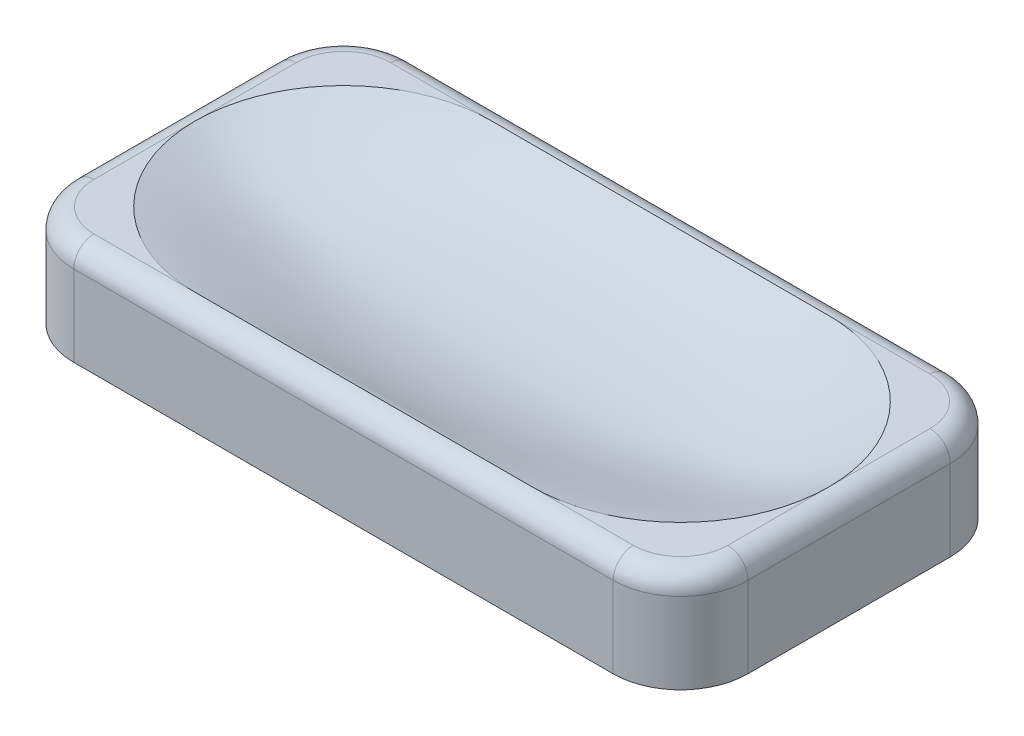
ISO-10303-21;
HEADER;
FILE_DESCRIPTION(('STEP AP214'),'2;1');
FILE_NAME('part.step','',(''),(''),'','','');
FILE_SCHEMA(('AUTOMOTIVE_DESIGN { 1 0 10303 214 1 1 1 1 }'));
ENDSEC;
DATA;
#1=APPLICATION_CONTEXT('core data for automotive mechanical design processes');
#2=APPLICATION_PROTOCOL_DEFINITION('international standard','automotive_design',2000,#1);
#3=PRODUCT_CONTEXT('',#1,'mechanical');
#4=PRODUCT('Part','Part','',(#3));
#5=PRODUCT_RELATED_PRODUCT_CATEGORY('part','',(#4));
#6=PRODUCT_DEFINITION_FORMATION('','',#4);
#7=PRODUCT_DEFINITION_CONTEXT('part definition',#1,'design');
#8=PRODUCT_DEFINITION('design','',#6,#7);
#9=PRODUCT_DEFINITION_SHAPE('','',#8);
#10=(LENGTH_UNIT() NAMED_UNIT(*) SI_UNIT(.MILLI.,.METRE.));
#11=(NAMED_UNIT(*) PLANE_ANGLE_UNIT() SI_UNIT($,.RADIAN.));
#12=(NAMED_UNIT(*) SI_UNIT($,.STERADIAN.) SOLID_ANGLE_UNIT());
#13=UNCERTAINTY_MEASURE_WITH_UNIT(LENGTH_MEASURE(1.E-05),#10,'distance_accuracy_value','');
#14=(GEOMETRIC_REPRESENTATION_CONTEXT(3) GLOBAL_UNCERTAINTY_ASSIGNED_CONTEXT((#13)) GLOBAL_UNIT_ASSIGNED_CONTEXT((#10,
#11,#12)) REPRESENTATION_CONTEXT('',''));
#15=CARTESIAN_POINT('',(0.,0.,0.));
#16=DIRECTION('',(0.,0.,1.));
#17=DIRECTION('',(1.,0.,0.));
#18=AXIS2_PLACEMENT_3D('',#15,#16,#17);
#19=CARTESIAN_POINT('',(-50.,15.,25.));
#20=DIRECTION('',(0.,1.,0.));
#21=DIRECTION('',(0.,0.,1.));
#22=AXIS2_PLACEMENT_3D('',#19,#20,#21);
#23=PLANE('',#22);
#24=DIRECTION('',(0.,0.,1.));
#25=VECTOR('',#24,1.);
#26=CARTESIAN_POINT('',(-47.,15.,15.));
#27=LINE('',#26,#25);
#28=CARTESIAN_POINT('',(-47.,15.,-15.));
#29=VERTEX_POINT('',#28);
#30=CARTESIAN_POINT('',(-46.9998353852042,14.9999178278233,-0.141706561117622));
#31=VERTEX_POINT('',#30);
#32=EDGE_CURVE('E217',#29,#31,#27,.T.);
#33=ORIENTED_EDGE('',*,*,#32,.T.);
#34=CARTESIAN_POINT('',(-24.999999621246,15.0001460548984,-21.9999594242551));
#35=CARTESIAN_POINT('',(-25.1801932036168,15.0005358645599,-21.9998396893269));
#36=CARTESIAN_POINT('',(-25.3603787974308,15.0006209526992,-21.9975559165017));
#37=CARTESIAN_POINT('',(-25.7201611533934,15.0005211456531,-21.9886395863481));
#38=CARTESIAN_POINT('',(-25.899758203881,15.0003369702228,-21.9820186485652));
#39=CARTESIAN_POINT('',(-26.437205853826,14.9998872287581,-21.955652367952));
#40=CARTESIAN_POINT('',(-26.7947600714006,14.9997227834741,-21.9294030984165));
#41=CARTESIAN_POINT('',(-27.5074955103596,14.9996802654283,-21.8595016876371));
#42=CARTESIAN_POINT('',(-27.8626798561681,14.9998016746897,-21.8158811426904));
#43=CARTESIAN_POINT('',(-28.5765183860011,14.9999761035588,-21.7103943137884));
#44=CARTESIAN_POINT('',(-28.9351286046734,15.0000279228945,-21.6482298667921));
#45=CARTESIAN_POINT('',(-29.6382887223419,15.0001037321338,-21.5083895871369));
#46=CARTESIAN_POINT('',(-29.9829408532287,15.0001284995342,-21.4312266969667));
#47=CARTESIAN_POINT('',(-30.6729943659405,15.0001436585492,-21.2591873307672));
#48=CARTESIAN_POINT('',(-31.0183370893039,15.000133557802,-21.1640752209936));
#49=CARTESIAN_POINT('',(-31.7038938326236,15.0000826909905,-20.9570290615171));
#50=CARTESIAN_POINT('',(-32.0441084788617,15.0000419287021,-20.8450970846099));
#51=CARTESIAN_POINT('',(-32.7305578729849,14.9999541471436,-20.600489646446));
#52=CARTESIAN_POINT('',(-33.0765816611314,14.9999069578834,-20.4672217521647));
#53=CARTESIAN_POINT('',(-33.7397733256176,14.9998696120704,-20.1925311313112));
#54=CARTESIAN_POINT('',(-34.0573787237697,14.9998760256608,-20.0521628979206));
#55=CARTESIAN_POINT('',(-34.6954782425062,14.9999003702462,-19.7518693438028));
#56=CARTESIAN_POINT('',(-35.0157483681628,14.9999186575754,-19.5914673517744));
#57=CARTESIAN_POINT('',(-35.648003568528,14.9999480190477,-19.2551506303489));
#58=CARTESIAN_POINT('',(-35.959989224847,14.9999590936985,-19.0792369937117));
#59=CARTESIAN_POINT('',(-36.5909263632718,14.9999795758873,-18.702846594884));
#60=CARTESIAN_POINT('',(-36.9094007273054,14.9999888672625,-18.5015692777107));
#61=CARTESIAN_POINT('',(-37.5062871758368,15.0000474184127,-18.1027279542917));
#62=CARTESIAN_POINT('',(-37.7856535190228,15.0000928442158,-17.9065891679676));
#63=CARTESIAN_POINT('',(-38.3485014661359,15.0001695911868,-17.4915177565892));
#64=CARTESIAN_POINT('',(-38.6315066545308,15.0002001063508,-17.2719380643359));
#65=CARTESIAN_POINT('',(-39.1863678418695,15.0002157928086,-16.8191857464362));
#66=CARTESIAN_POINT('',(-39.4582250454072,15.0002009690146,-16.586014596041));
#67=CARTESIAN_POINT('',(-40.0083849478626,15.0001380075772,-16.0902814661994));
#68=CARTESIAN_POINT('',(-40.2858599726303,15.0000876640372,-15.8267997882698));
#69=CARTESIAN_POINT('',(-40.7935151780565,15.0000332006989,-15.319169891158));
#70=CARTESIAN_POINT('',(-41.0253124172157,15.000024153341,-15.0766348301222));
#71=CARTESIAN_POINT('',(-41.4928733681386,15.0000052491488,-14.5644298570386));
#72=CARTESIAN_POINT('',(-41.7278437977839,14.9999953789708,-14.2940344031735));
#73=CARTESIAN_POINT('',(-42.1841722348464,14.999966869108,-13.7421025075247));
#74=CARTESIAN_POINT('',(-42.405533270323,14.999948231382,-13.4605685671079));
#75=CARTESIAN_POINT('',(-42.8523668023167,14.9999200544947,-12.8627104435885));
#76=CARTESIAN_POINT('',(-43.0766005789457,14.9999114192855,-12.5454588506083));
#77=CARTESIAN_POINT('',(-43.4753783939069,14.9999711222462,-11.9486200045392));
#78=CARTESIAN_POINT('',(-43.652301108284,15.0000279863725,-11.6706167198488));
#79=CARTESIAN_POINT('',(-44.008307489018,15.0001382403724,-11.0824239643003));
#80=CARTESIAN_POINT('',(-44.1862422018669,15.000190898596,-10.7715372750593));
#81=CARTESIAN_POINT('',(-44.5266182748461,15.000234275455,-10.1414580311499));
#82=CARTESIAN_POINT('',(-44.689061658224,15.0002250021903,-9.82226656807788));
#83=CARTESIAN_POINT('',(-45.0138048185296,15.0001523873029,-9.14359764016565));
#84=CARTESIAN_POINT('',(-45.1744240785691,15.0000836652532,-8.78331392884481));
#85=CARTESIAN_POINT('',(-45.449199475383,15.0000137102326,-8.12002045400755));
#86=CARTESIAN_POINT('',(-45.5665239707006,15.000002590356,-7.81831637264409));
#87=CARTESIAN_POINT('',(-45.7995209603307,14.999983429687,-7.17759104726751));
#88=CARTESIAN_POINT('',(-45.913685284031,14.99997584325,-6.83801905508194));
#89=CARTESIAN_POINT('',(-46.1251653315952,14.9999594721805,-6.15380260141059));
#90=CARTESIAN_POINT('',(-46.2224866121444,14.9999506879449,-5.80915985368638));
#91=CARTESIAN_POINT('',(-46.4105739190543,14.999950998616,-5.07473135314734));
#92=CARTESIAN_POINT('',(-46.4992247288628,14.9999623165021,-4.68440114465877));
#93=CARTESIAN_POINT('',(-46.6392630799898,15.0000788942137,-3.9802240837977));
#94=CARTESIAN_POINT('',(-46.6945645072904,15.0001643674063,-3.66714671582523));
#95=CARTESIAN_POINT('',(-46.797720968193,15.000318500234,-2.99901652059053));
#96=CARTESIAN_POINT('',(-46.8437410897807,15.0003836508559,-2.64367765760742));
#97=CARTESIAN_POINT('',(-46.9182584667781,15.000358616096,-1.93138365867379));
#98=CARTESIAN_POINT('',(-46.9467659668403,15.0002685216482,-1.57442959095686));
#99=CARTESIAN_POINT('',(-46.9863391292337,15.0000475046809,-0.858905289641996));
#100=CARTESIAN_POINT('',(-46.9973730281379,14.9999165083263,-0.500333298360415));
#101=CARTESIAN_POINT('',(-46.9996377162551,14.9998227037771,-0.14170609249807));
#102=B_SPLINE_CURVE_WITH_KNOTS('',3,(#34,#35,#36,#37,#38,#39,#40,#41,#42,#43,#44,#45,#46,#47,
#48,#49,#50,#51,#52,#53,#54,#55,#56,#57,#58,#59,#60,#61,#62,#63,#64,#65,#66,#67,#68,#69,#70,#71,
#72,#73,#74,#75,#76,#77,#78,#79,#80,#81,#82,#83,#84,#85,#86,#87,#88,#89,#90,#91,#92,#93,#94,#95,
#96,#97,#98,#99,#100,#101),.UNSPECIFIED.,.F.,.F.,(4,2,2,2,2,2,2,2,2,2,2,2,2,2,2,2,2,2,2,2,2,2,2,
2,2,2,2,2,2,2,2,2,2,4),(0.,0.540554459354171,1.07966662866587,2.15475294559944,3.22789267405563,
4.31931366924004,5.37846617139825,6.45263543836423,7.5266724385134,8.63859496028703,
9.67994180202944,10.7540816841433,11.8281459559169,12.9578812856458,13.9815611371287,
15.0557215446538,16.1297655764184,17.2771569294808,18.2832941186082,19.3575254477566,
20.431516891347,21.5964399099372,22.5847082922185,23.658881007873,24.732913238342,
25.9157132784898,26.886563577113,27.9608643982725,29.0348101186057,30.2349930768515,
31.188494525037,32.2629692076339,33.3368147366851,34.4126100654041),.UNSPECIFIED.);
#103=CARTESIAN_POINT('',(-24.9999831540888,15.000059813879,-21.9999833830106));
#104=VERTEX_POINT('',#103);
#105=EDGE_CURVE('E199',#104,#31,#102,.T.);
#106=ORIENTED_EDGE('',*,*,#105,.F.);
#107=DIRECTION('',(-1.,0.,0.));
#108=VECTOR('',#107,1.);
#109=CARTESIAN_POINT('',(-40.,15.,-22.));
#110=LINE('',#109,#108);
#111=CARTESIAN_POINT('',(-40.,15.,-22.));
#112=VERTEX_POINT('',#111);
#113=EDGE_CURVE('E214',#104,#112,#110,.T.);
#114=ORIENTED_EDGE('',*,*,#113,.T.);
#115=CARTESIAN_POINT('',(-40.,15.,-15.));
#116=DIRECTION('',(0.,1.,0.));
#117=DIRECTION('',(0.,0.,1.));
#118=AXIS2_PLACEMENT_3D('',#115,#116,#117);
#119=CIRCLE('',#118,7.);
#120=EDGE_CURVE('E231',#112,#29,#119,.T.);
#121=ORIENTED_EDGE('',*,*,#120,.T.);
#122=EDGE_LOOP('',(#33,#106,#114,#121));
#123=FACE_BOUND('',#122,.T.);
#124=ADVANCED_FACE('F64',(#123),#23,.T.);
#125=DIRECTION('',(1.,0.,0.));
#126=VECTOR('',#125,1.);
#127=CARTESIAN_POINT('',(40.,15.,22.));
#128=LINE('',#127,#126);
#129=CARTESIAN_POINT('',(-40.,15.,22.));
#130=VERTEX_POINT('',#129);
#131=CARTESIAN_POINT('',(-24.999972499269,15.0000501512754,21.999986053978));
#132=VERTEX_POINT('',#131);
#133=EDGE_CURVE('E260',#130,#132,#128,.T.);
#134=ORIENTED_EDGE('',*,*,#133,.T.);
#135=CARTESIAN_POINT('',(-46.9996386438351,14.9998231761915,0.141636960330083));
#136=CARTESIAN_POINT('',(-46.9973761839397,14.9999179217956,0.500254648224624));
#137=CARTESIAN_POINT('',(-46.9863440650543,15.0000490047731,0.858817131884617));
#138=CARTESIAN_POINT('',(-46.9467740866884,15.0002694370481,1.57432988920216));
#139=CARTESIAN_POINT('',(-46.9182676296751,15.0003588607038,1.93128190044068));
#140=CARTESIAN_POINT('',(-46.8437518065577,15.0003827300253,2.64357920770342));
#141=CARTESIAN_POINT('',(-46.797731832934,15.0003170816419,2.99892339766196));
#142=CARTESIAN_POINT('',(-46.6945731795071,15.0001630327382,3.6670884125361));
#143=CARTESIAN_POINT('',(-46.639268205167,15.0000780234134,3.98019507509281));
#144=CARTESIAN_POINT('',(-46.4992320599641,14.9999624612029,4.6843706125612));
#145=CARTESIAN_POINT('',(-46.4105898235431,14.9999516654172,5.07467057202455));
#146=CARTESIAN_POINT('',(-46.2225137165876,14.9999514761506,5.80906682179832));
#147=CARTESIAN_POINT('',(-46.1251937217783,14.9999599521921,6.15370721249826));
#148=CARTESIAN_POINT('',(-45.9137141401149,14.9999757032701,6.83792705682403));
#149=CARTESIAN_POINT('',(-45.7995486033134,14.9999829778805,7.17750467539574));
#150=CARTESIAN_POINT('',(-45.5665426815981,15.000002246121,7.81826295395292));
#151=CARTESIAN_POINT('',(-45.4492093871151,15.000013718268,8.11999395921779));
#152=CARTESIAN_POINT('',(-45.1744357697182,15.0000843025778,8.78328811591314));
#153=CARTESIAN_POINT('',(-45.0138295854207,15.0001532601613,9.14354662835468));
#154=CARTESIAN_POINT('',(-44.6891022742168,15.0002255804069,9.82218873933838));
#155=CARTESIAN_POINT('',(-44.5266605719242,15.0002343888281,10.1413780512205));
#156=CARTESIAN_POINT('',(-44.1862842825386,15.0001902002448,10.7714603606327));
#157=CARTESIAN_POINT('',(-44.0083473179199,15.0001371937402,11.0823520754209));
#158=CARTESIAN_POINT('',(-43.6523271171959,15.0000270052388,11.670572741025));
#159=CARTESIAN_POINT('',(-43.4753919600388,14.9999704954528,11.9485983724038));
#160=CARTESIAN_POINT('',(-43.0766157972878,14.999911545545,12.5454380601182));
#161=CARTESIAN_POINT('',(-42.8523981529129,14.9999205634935,12.8626695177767));
#162=CARTESIAN_POINT('',(-42.4055836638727,14.9999488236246,13.4605061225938));
#163=CARTESIAN_POINT('',(-42.1842246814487,14.9999672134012,13.7420380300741));
#164=CARTESIAN_POINT('',(-41.7278953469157,14.9999952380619,14.2939724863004));
#165=CARTESIAN_POINT('',(-41.4929216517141,15.0000048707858,14.5643722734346));
#166=CARTESIAN_POINT('',(-41.0253431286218,15.0000238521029,15.0765999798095));
#167=CARTESIAN_POINT('',(-40.7935309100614,15.0000331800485,15.3191528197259));
#168=CARTESIAN_POINT('',(-40.2858768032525,15.0000881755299,15.8267842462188));
#169=CARTESIAN_POINT('',(-40.0084194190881,15.0001387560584,16.090251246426));
#170=CARTESIAN_POINT('',(-39.458280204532,15.0002016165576,16.5859686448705));
#171=CARTESIAN_POINT('',(-39.1864254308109,15.0002161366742,16.8191380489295));
#172=CARTESIAN_POINT('',(-38.6315629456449,15.0001998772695,17.2718923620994));
#173=CARTESIAN_POINT('',(-38.3485537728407,15.0001690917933,17.4914754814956));
#174=CARTESIAN_POINT('',(-37.7856862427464,15.0000923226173,17.9065639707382));
#175=CARTESIAN_POINT('',(-37.5063038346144,15.0000471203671,18.1027157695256));
#176=CARTESIAN_POINT('',(-36.9094180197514,14.9999890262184,18.5015589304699));
#177=CARTESIAN_POINT('',(-36.5909614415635,14.9999799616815,18.7028267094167));
#178=CARTESIAN_POINT('',(-35.9600452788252,14.9999593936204,19.0792068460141));
#179=CARTESIAN_POINT('',(-35.6480624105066,14.9999480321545,19.2551190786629));
#180=CARTESIAN_POINT('',(-35.0158056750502,14.9999180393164,19.5914371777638));
#181=CARTESIAN_POINT('',(-34.6955310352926,14.9998994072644,19.7518415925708));
#182=CARTESIAN_POINT('',(-34.0574112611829,14.9998747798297,20.0521467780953));
#183=CARTESIAN_POINT('',(-33.7397898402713,14.9998684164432,20.1925236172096));
#184=CARTESIAN_POINT('',(-33.0765983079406,14.9999058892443,20.4672162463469));
#185=CARTESIAN_POINT('',(-32.7305913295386,14.9999531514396,20.6004791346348));
#186=CARTESIAN_POINT('',(-32.0441620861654,15.0000408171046,20.8450811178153));
#187=CARTESIAN_POINT('',(-31.7039505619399,15.0000813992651,20.9570120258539));
#188=CARTESIAN_POINT('',(-31.0183921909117,15.0001322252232,21.1640587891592));
#189=CARTESIAN_POINT('',(-30.6730445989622,15.0001424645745,21.2591721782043));
#190=CARTESIAN_POINT('',(-29.9829712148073,15.0001281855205,21.4312178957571));
#191=CARTESIAN_POINT('',(-29.638303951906,15.0001041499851,21.5083853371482));
#192=CARTESIAN_POINT('',(-28.9351381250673,15.0000297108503,21.6482286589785));
#193=CARTESIAN_POINT('',(-28.5765375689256,14.9999785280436,21.7103928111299));
#194=CARTESIAN_POINT('',(-27.8627105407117,14.999803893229,21.8158795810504));
#195=CARTESIAN_POINT('',(-27.5075279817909,14.9996816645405,21.8595000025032));
#196=CARTESIAN_POINT('',(-26.7947911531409,14.9997219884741,21.9294017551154));
#197=CARTESIAN_POINT('',(-26.4372337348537,14.9998850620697,21.9556512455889));
#198=CARTESIAN_POINT('',(-25.8997794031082,15.0003344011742,21.9820180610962));
#199=CARTESIAN_POINT('',(-25.7201788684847,15.0005187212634,21.9886392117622));
#200=CARTESIAN_POINT('',(-25.3603882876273,15.0006186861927,21.997556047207));
#201=CARTESIAN_POINT('',(-25.1801979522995,15.0005336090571,21.9998400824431));
#202=CARTESIAN_POINT('',(-24.9999996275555,15.000143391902,21.9999601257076));
#203=B_SPLINE_CURVE_WITH_KNOTS('',3,(#135,#136,#137,#138,#139,#140,#141,#142,#143,#144,#145,
#146,#147,#148,#149,#150,#151,#152,#153,#154,#155,#156,#157,#158,#159,#160,#161,#162,#163,#164,
#165,#166,#167,#168,#169,#170,#171,#172,#173,#174,#175,#176,#177,#178,#179,#180,#181,#182,#183,
#184,#185,#186,#187,#188,#189,#190,#191,#192,#193,#194,#195,#196,#197,#198,#199,#200,#201,#202),
.UNSPECIFIED.,.F.,.F.,(4,2,2,2,2,2,2,2,2,2,2,2,2,2,2,2,2,2,2,2,2,2,2,2,2,2,2,2,2,2,2,2,2,4),(0.,
1.07576666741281,2.14960576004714,3.22409628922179,4.17768608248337,5.37777492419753,
6.45171273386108,7.52603077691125,8.4969658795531,9.67968096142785,10.7537050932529,
11.8278943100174,12.8162392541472,13.98108505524,15.0550678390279,16.1293154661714,
17.1355222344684,18.2828449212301,19.3568799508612,20.4310561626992,21.4547978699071,
22.5844728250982,23.6585276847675,24.7326829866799,25.7740842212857,26.8859542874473,
27.9599813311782,29.0341657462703,30.0933655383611,31.1847578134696,32.2578921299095,
33.332988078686,33.8721107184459,34.4126794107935),.UNSPECIFIED.);
#204=CARTESIAN_POINT('',(-46.9998333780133,14.9999167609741,0.141637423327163));
#205=VERTEX_POINT('',#204);
#206=EDGE_CURVE('E599',#205,#132,#203,.T.);
#207=ORIENTED_EDGE('',*,*,#206,.F.);
#208=CARTESIAN_POINT('',(-47.,15.,15.));
#209=VERTEX_POINT('',#208);
#210=EDGE_CURVE('E245',#205,#209,#27,.T.);
#211=ORIENTED_EDGE('',*,*,#210,.T.);
#212=CARTESIAN_POINT('',(-40.,15.,15.));
#213=DIRECTION('',(0.,1.,0.));
#214=DIRECTION('',(0.,0.,1.));
#215=AXIS2_PLACEMENT_3D('',#212,#213,#214);
#216=CIRCLE('',#215,7.);
#217=EDGE_CURVE('E248',#209,#130,#216,.T.);
#218=ORIENTED_EDGE('',*,*,#217,.T.);
#219=EDGE_LOOP('',(#134,#207,#211,#218));
#220=FACE_BOUND('',#219,.T.);
#221=ADVANCED_FACE('F402',(#220),#23,.T.);
#222=DIRECTION('',(0.,0.,-1.));
#223=VECTOR('',#222,1.);
#224=CARTESIAN_POINT('',(47.,15.,-15.));
#225=LINE('',#224,#223);
#226=CARTESIAN_POINT('',(47.,15.,15.));
#227=VERTEX_POINT('',#226);
#228=CARTESIAN_POINT('',(46.9998411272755,14.9999206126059,0.139275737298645));
#229=VERTEX_POINT('',#228);
#230=EDGE_CURVE('E233',#227,#229,#225,.T.);
#231=ORIENTED_EDGE('',*,*,#230,.T.);
#232=CARTESIAN_POINT('',(24.9999999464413,15.0000210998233,21.9999937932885));
#233=CARTESIAN_POINT('',(25.1802241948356,15.0004165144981,21.9998703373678));
#234=CARTESIAN_POINT('',(25.3604404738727,15.0005301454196,21.9975829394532));
#235=CARTESIAN_POINT('',(25.720279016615,15.0004986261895,21.9886592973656));
#236=CARTESIAN_POINT('',(25.8999015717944,15.000354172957,21.9820347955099));
#237=CARTESIAN_POINT('',(26.4374102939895,14.9999888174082,21.9556580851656));
#238=CARTESIAN_POINT('',(26.7949999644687,14.9998346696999,21.9294021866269));
#239=CARTESIAN_POINT('',(27.5077856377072,14.9997317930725,21.8594870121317));
#240=CARTESIAN_POINT('',(27.8629848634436,14.9997826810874,21.8158603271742));
#241=CARTESIAN_POINT('',(28.5767314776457,14.9998993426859,21.7103743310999));
#242=CARTESIAN_POINT('',(28.9352357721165,14.9999653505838,21.6482228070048));
#243=CARTESIAN_POINT('',(29.6384152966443,15.0000767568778,21.5083712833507));
#244=CARTESIAN_POINT('',(29.9831905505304,15.0001226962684,21.4311731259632));
#245=CARTESIAN_POINT('',(30.67338829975,15.0001684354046,21.2590783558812));
#246=CARTESIAN_POINT('',(31.0187533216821,15.0001675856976,21.1639509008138));
#247=CARTESIAN_POINT('',(31.7043532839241,15.0001263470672,20.9568730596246));
#248=CARTESIAN_POINT('',(32.0445888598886,15.0000859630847,20.8449247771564));
#249=CARTESIAN_POINT('',(32.7308875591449,14.999996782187,20.6003521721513));
#250=CARTESIAN_POINT('',(33.0767431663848,14.999947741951,20.4671451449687));
#251=CARTESIAN_POINT('',(33.7399810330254,14.9999031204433,20.1924375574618));
#252=CARTESIAN_POINT('',(34.0577932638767,14.9999043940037,20.0519733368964));
#253=CARTESIAN_POINT('',(34.6961129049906,14.9999194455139,19.7515539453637));
#254=CARTESIAN_POINT('',(35.0164003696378,14.9999336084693,19.5911307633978));
#255=CARTESIAN_POINT('',(35.64868883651,14.999957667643,19.2547693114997));
#256=CARTESIAN_POINT('',(35.960690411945,14.9999675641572,19.0788321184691));
#257=CARTESIAN_POINT('',(36.5913958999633,14.9999875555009,18.7025472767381));
#258=CARTESIAN_POINT('',(36.9096306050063,14.9999976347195,18.5014124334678));
#259=CARTESIAN_POINT('',(37.506566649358,15.0000572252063,18.1025377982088));
#260=CARTESIAN_POINT('',(37.7862056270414,15.00010301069,17.90619844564));
#261=CARTESIAN_POINT('',(38.349330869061,15.0001754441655,17.4908853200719));
#262=CARTESIAN_POINT('',(38.6323492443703,15.0002010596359,17.2712761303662));
#263=CARTESIAN_POINT('',(39.1872302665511,15.0002018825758,16.8184668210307));
#264=CARTESIAN_POINT('',(39.4590942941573,15.0001770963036,16.5852683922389));
#265=CARTESIAN_POINT('',(40.0089588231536,15.0000955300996,16.0897546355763));
#266=CARTESIAN_POINT('',(40.2861459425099,15.0000367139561,15.8265355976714));
#267=CARTESIAN_POINT('',(40.7938175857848,14.9999783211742,15.3188909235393));
#268=CARTESIAN_POINT('',(41.0258919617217,14.9999724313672,15.0760513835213));
#269=CARTESIAN_POINT('',(41.4937099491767,14.9999683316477,14.5635009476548));
#270=CARTESIAN_POINT('',(41.7286733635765,14.9999706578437,14.2930765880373));
#271=CARTESIAN_POINT('',(42.1849941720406,14.999968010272,13.7410754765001));
#272=CARTESIAN_POINT('',(42.4063540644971,14.999963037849,13.4595007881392));
#273=CARTESIAN_POINT('',(42.8528874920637,14.9999568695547,12.8619531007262));
#274=CARTESIAN_POINT('',(43.0768430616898,14.9999560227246,12.5450684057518));
#275=CARTESIAN_POINT('',(43.4756659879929,15.0000213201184,11.948157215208));
#276=CARTESIAN_POINT('',(43.6528712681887,15.0000774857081,11.6696876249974));
#277=CARTESIAN_POINT('',(44.0091335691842,15.0001803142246,11.0809777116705));
#278=CARTESIAN_POINT('',(44.1870613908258,15.0002257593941,10.770052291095));
#279=CARTESIAN_POINT('',(44.5274170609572,15.0002535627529,10.1399030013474));
#280=CARTESIAN_POINT('',(44.6898473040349,15.0002359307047,9.82068042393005));
#281=CARTESIAN_POINT('',(45.0142915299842,15.0001499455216,9.14250647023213));
#282=CARTESIAN_POINT('',(45.1746547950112,15.0000767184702,8.78276333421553));
#283=CARTESIAN_POINT('',(45.4494425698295,15.0000036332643,8.11944462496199));
#284=CARTESIAN_POINT('',(45.5669810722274,14.9999931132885,7.81715245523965));
#285=CARTESIAN_POINT('',(45.8001437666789,14.9999770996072,7.17579945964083));
#286=CARTESIAN_POINT('',(45.9142846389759,14.9999722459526,6.83619714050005));
#287=CARTESIAN_POINT('',(46.1257170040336,14.9999602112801,6.15191452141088));
#288=CARTESIAN_POINT('',(46.2230137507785,14.99995303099,5.80723584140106));
#289=CARTESIAN_POINT('',(46.4108720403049,14.9999544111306,5.073415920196));
#290=CARTESIAN_POINT('',(46.4993554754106,14.9999648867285,4.68374003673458));
#291=CARTESIAN_POINT('',(46.6394054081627,15.0000788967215,3.97950668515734));
#292=CARTESIAN_POINT('',(46.6948190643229,15.0001631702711,3.66570573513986));
#293=CARTESIAN_POINT('',(46.798024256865,15.0003147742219,2.99681946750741));
#294=CARTESIAN_POINT('',(46.844010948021,15.0003786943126,2.6414530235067));
#295=CARTESIAN_POINT('',(46.9184591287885,15.0003538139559,1.92910228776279));
#296=CARTESIAN_POINT('',(46.9469307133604,15.0002651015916,1.57211904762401));
#297=CARTESIAN_POINT('',(46.9864296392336,15.0000481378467,0.856534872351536));
#298=CARTESIAN_POINT('',(46.9974250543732,14.9999198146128,0.497932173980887));
#299=CARTESIAN_POINT('',(46.9996500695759,14.9998286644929,0.139275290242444));
#300=B_SPLINE_CURVE_WITH_KNOTS('',3,(#232,#233,#234,#235,#236,#237,#238,#239,#240,#241,#242,
#243,#244,#245,#246,#247,#248,#249,#250,#251,#252,#253,#254,#255,#256,#257,#258,#259,#260,#261,
#262,#263,#264,#265,#266,#267,#268,#269,#270,#271,#272,#273,#274,#275,#276,#277,#278,#279,#280,
#281,#282,#283,#284,#285,#286,#287,#288,#289,#290,#291,#292,#293,#294,#295,#296,#297,#298,#299),
.UNSPECIFIED.,.F.,.F.,(4,2,2,2,2,2,2,2,2,2,2,2,2,2,2,2,2,2,2,2,2,2,2,2,2,2,2,2,2,2,2,2,2,4),(0.,
0.540646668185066,1.07983560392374,2.15502952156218,3.22821559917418,4.31931717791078,
5.37885276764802,6.45309882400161,7.52721064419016,8.63859762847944,9.68062750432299,
10.7548423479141,11.8289826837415,12.9578832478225,13.982577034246,15.0568230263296,
16.1309356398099,17.2771599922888,18.2845303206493,19.3588133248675,20.432898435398,
21.5964434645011,22.5863453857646,23.6606088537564,24.7347060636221,25.9157153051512,
26.8884404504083,27.9628052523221,29.0368343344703,30.2349956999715,31.1906910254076,
32.2652349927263,33.3391590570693,34.4150427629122),.UNSPECIFIED.);
#301=CARTESIAN_POINT('',(24.9921031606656,15.0000012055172,21.9999937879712));
#302=VERTEX_POINT('',#301);
#303=EDGE_CURVE('E208',#302,#229,#300,.T.);
#304=ORIENTED_EDGE('',*,*,#303,.F.);
#305=CARTESIAN_POINT('',(40.,15.,22.));
#306=VERTEX_POINT('',#305);
#307=EDGE_CURVE('E255',#302,#306,#128,.T.);
#308=ORIENTED_EDGE('',*,*,#307,.T.);
#309=CARTESIAN_POINT('',(40.,15.,15.));
#310=DIRECTION('',(0.,1.,0.));
#311=DIRECTION('',(0.,0.,1.));
#312=AXIS2_PLACEMENT_3D('',#309,#310,#311);
#313=CIRCLE('',#312,7.);
#314=EDGE_CURVE('E265',#306,#227,#313,.T.);
#315=ORIENTED_EDGE('',*,*,#314,.T.);
#316=EDGE_LOOP('',(#231,#304,#308,#315));
#317=FACE_BOUND('',#316,.T.);
#318=ADVANCED_FACE('F407',(#317),#23,.T.);
#319=CARTESIAN_POINT('',(40.,15.,-22.));
#320=VERTEX_POINT('',#319);
#321=CARTESIAN_POINT('',(24.9953758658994,15.,-22.));
#322=VERTEX_POINT('',#321);
#323=EDGE_CURVE('E227',#320,#322,#110,.T.);
#324=ORIENTED_EDGE('',*,*,#323,.T.);
#325=CARTESIAN_POINT('',(46.9996522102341,14.9998297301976,-0.138959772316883));
#326=CARTESIAN_POINT('',(46.9974326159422,14.999923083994,-0.497612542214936));
#327=CARTESIAN_POINT('',(46.9864423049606,15.000051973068,-0.856211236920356));
#328=CARTESIAN_POINT('',(46.9469532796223,15.0002685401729,-1.5717929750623));
#329=CARTESIAN_POINT('',(46.9184862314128,15.000356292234,-1.92877776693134));
#330=CARTESIAN_POINT('',(46.8440466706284,15.0003794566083,-2.64113712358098));
#331=CARTESIAN_POINT('',(46.7980638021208,15.0003147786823,-2.99651060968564));
#332=CARTESIAN_POINT('',(46.6948522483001,15.0001628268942,-3.66550527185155));
#333=CARTESIAN_POINT('',(46.639424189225,15.0000788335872,-3.97940688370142));
#334=CARTESIAN_POINT('',(46.4993762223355,14.9999655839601,-4.68364103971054));
#335=CARTESIAN_POINT('',(46.4109186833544,14.9999555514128,-5.07321893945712));
#336=CARTESIAN_POINT('',(46.2230952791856,14.9999542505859,-5.80694326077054));
#337=CARTESIAN_POINT('',(46.1258023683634,14.9999611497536,-6.1516229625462));
#338=CARTESIAN_POINT('',(45.914375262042,14.9999726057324,-6.83591579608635));
#339=CARTESIAN_POINT('',(45.8002354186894,14.9999771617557,-7.17552718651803));
#340=CARTESIAN_POINT('',(45.5670464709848,14.9999932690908,-7.81697837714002));
#341=CARTESIAN_POINT('',(45.4494770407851,15.0000041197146,-8.11935831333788));
#342=CARTESIAN_POINT('',(45.1746889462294,15.0000777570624,-8.78268286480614));
#343=CARTESIAN_POINT('',(45.0143643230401,15.0001511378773,-9.1423473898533));
#344=CARTESIAN_POINT('',(44.6899658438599,15.0002366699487,-9.82044623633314));
#345=CARTESIAN_POINT('',(44.5275386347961,15.0002537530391,-10.1396703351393));
#346=CARTESIAN_POINT('',(44.1871852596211,15.0002249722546,-10.7698298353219));
#347=CARTESIAN_POINT('',(44.0092563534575,15.0001790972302,-11.0807637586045));
#348=CARTESIAN_POINT('',(43.6529553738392,15.000076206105,-11.6695525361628));
#349=CARTESIAN_POINT('',(43.4757096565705,15.0000203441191,-11.9480907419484));
#350=CARTESIAN_POINT('',(43.0768856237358,14.9999557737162,-12.5450069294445));
#351=CARTESIAN_POINT('',(42.8529755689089,14.9999570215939,-12.8618321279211));
#352=CARTESIAN_POINT('',(42.4064929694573,14.9999633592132,-13.4593240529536));
#353=CARTESIAN_POINT('',(42.1851353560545,14.9999681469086,-13.7409001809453));
#354=CARTESIAN_POINT('',(41.7288138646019,14.9999704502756,-14.2929106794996));
#355=CARTESIAN_POINT('',(41.4938471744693,14.9999679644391,-14.5633427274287));
#356=CARTESIAN_POINT('',(41.0259833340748,14.9999722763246,-15.075952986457));
#357=CARTESIAN_POINT('',(40.7938643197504,14.9999785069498,-15.3188427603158));
#358=CARTESIAN_POINT('',(40.2861899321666,15.0000375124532,-15.8264927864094));
#359=CARTESIAN_POINT('',(40.0090490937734,15.0000965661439,-16.0896713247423));
#360=CARTESIAN_POINT('',(39.459234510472,15.0001779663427,-16.5851482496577));
#361=CARTESIAN_POINT('',(39.1873721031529,15.0002023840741,-16.8183480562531));
#362=CARTESIAN_POINT('',(38.6324880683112,15.0002008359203,-17.2711653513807));
#363=CARTESIAN_POINT('',(38.3494648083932,15.0001748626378,-17.490780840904));
#364=CARTESIAN_POINT('',(37.7862930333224,15.0001022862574,-17.9061349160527));
#365=CARTESIAN_POINT('',(37.5066110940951,15.0000566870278,-18.1025071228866));
#366=CARTESIAN_POINT('',(36.9096716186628,14.999997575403,-18.5013863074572));
#367=CARTESIAN_POINT('',(36.591479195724,14.9999877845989,-18.7024969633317));
#368=CARTESIAN_POINT('',(35.960818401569,14.9999679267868,-19.0787606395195));
#369=CARTESIAN_POINT('',(35.6488180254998,14.9999578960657,-19.2546988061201));
#370=CARTESIAN_POINT('',(35.0165246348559,14.9999335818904,-19.591066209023));
#371=CARTESIAN_POINT('',(34.6962308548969,14.9999192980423,-19.7514940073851));
#372=CARTESIAN_POINT('',(34.057868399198,14.9999044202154,-20.0519380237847));
#373=CARTESIAN_POINT('',(33.7400189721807,14.9999034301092,-20.1924207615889));
#374=CARTESIAN_POINT('',(33.0767764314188,14.9999484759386,-20.4671322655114));
#375=CARTESIAN_POINT('',(32.7309547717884,14.9999976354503,-20.6003281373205));
#376=CARTESIAN_POINT('',(32.0446915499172,15.0000867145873,-20.8448916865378));
#377=CARTESIAN_POINT('',(31.7044569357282,15.0001268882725,-20.9568404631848));
#378=CARTESIAN_POINT('',(31.0188508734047,15.0001681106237,-21.1639218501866));
#379=CARTESIAN_POINT('',(30.673478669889,15.0001691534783,-21.259051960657));
#380=CARTESIAN_POINT('',(29.9832462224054,15.0001242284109,-21.431158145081));
#381=CARTESIAN_POINT('',(29.6384432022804,15.0000789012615,-21.5083640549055));
#382=CARTESIAN_POINT('',(28.9352519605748,14.9999682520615,-21.6482199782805));
#383=CARTESIAN_POINT('',(28.5767641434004,14.9999023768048,-21.7103703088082));
#384=CARTESIAN_POINT('',(27.8630331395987,14.9997845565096,-21.8158565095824));
#385=CARTESIAN_POINT('',(27.5078329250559,14.9997324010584,-21.8594837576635));
#386=CARTESIAN_POINT('',(26.7950408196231,14.9998334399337,-21.9294002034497));
#387=CARTESIAN_POINT('',(26.4374456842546,14.999987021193,-21.9556565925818));
#388=CARTESIAN_POINT('',(25.8999270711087,15.0003528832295,-21.9820339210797));
#389=CARTESIAN_POINT('',(25.7203000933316,15.0004977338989,-21.9886586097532));
#390=CARTESIAN_POINT('',(25.360451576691,15.0005299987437,-21.9975825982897));
#391=CARTESIAN_POINT('',(25.180229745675,15.0004167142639,-21.9998701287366));
#392=CARTESIAN_POINT('',(24.9999999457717,15.0000213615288,-21.9999937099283));
#393=B_SPLINE_CURVE_WITH_KNOTS('',3,(#325,#326,#327,#328,#329,#330,#331,#332,#333,#334,#335,
#336,#337,#338,#339,#340,#341,#342,#343,#344,#345,#346,#347,#348,#349,#350,#351,#352,#353,#354,
#355,#356,#357,#358,#359,#360,#361,#362,#363,#364,#365,#366,#367,#368,#369,#370,#371,#372,#373,
#374,#375,#376,#377,#378,#379,#380,#381,#382,#383,#384,#385,#386,#387,#388,#389,#390,#391,#392),
.UNSPECIFIED.,.F.,.F.,(4,2,2,2,2,2,2,2,2,2,2,2,2,2,2,2,2,2,2,2,2,2,2,2,2,2,2,2,2,2,2,2,2,4),(0.,
1.07587123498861,2.14979882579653,3.22436234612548,4.18036228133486,5.37822024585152,
6.45224905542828,7.52663874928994,8.49964266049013,9.68038968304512,10.7544867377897,
11.8287740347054,12.8189145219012,13.9822352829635,15.0563194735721,16.1306264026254,
17.1381980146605,18.2842382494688,19.3583497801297,20.4326189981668,21.4574747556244,
22.5862294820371,23.6603680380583,24.7346060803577,25.7767603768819,26.8880403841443,
27.9621498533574,29.0364188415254,30.0960407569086,31.1870930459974,32.2602822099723,
33.3354925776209,33.8746947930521,34.4153581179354),.UNSPECIFIED.);
#394=CARTESIAN_POINT('',(46.9998394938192,14.9999198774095,-0.138960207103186));
#395=VERTEX_POINT('',#394);
#396=EDGE_CURVE('E279',#395,#322,#393,.T.);
#397=ORIENTED_EDGE('',*,*,#396,.F.);
#398=CARTESIAN_POINT('',(47.,15.,-15.));
#399=VERTEX_POINT('',#398);
#400=EDGE_CURVE('E267',#395,#399,#225,.T.);
#401=ORIENTED_EDGE('',*,*,#400,.T.);
#402=CARTESIAN_POINT('',(40.,15.,-15.));
#403=DIRECTION('',(0.,1.,0.));
#404=DIRECTION('',(0.,0.,1.));
#405=AXIS2_PLACEMENT_3D('',#402,#403,#404);
#406=CIRCLE('',#405,7.);
#407=EDGE_CURVE('E228',#399,#320,#406,.T.);
#408=ORIENTED_EDGE('',*,*,#407,.T.);
#409=EDGE_LOOP('',(#324,#397,#401,#408));
#410=FACE_BOUND('',#409,.T.);
#411=ADVANCED_FACE('F277',(#410),#23,.T.);
#412=CARTESIAN_POINT('',(-50.,15.,-25.));
#413=DIRECTION('',(1.,0.,0.));
#414=DIRECTION('',(0.,0.,-1.));
#415=AXIS2_PLACEMENT_3D('',#412,#413,#414);
#416=PLANE('',#415);
#417=DIRECTION('',(0.,-1.,0.));
#418=VECTOR('',#417,1.);
#419=CARTESIAN_POINT('',(-50.,15.,15.));
#420=LINE('',#419,#418);
#421=CARTESIAN_POINT('',(-50.,0.,15.));
#422=VERTEX_POINT('',#421);
#423=CARTESIAN_POINT('',(-50.,12.,15.));
#424=VERTEX_POINT('',#423);
#425=EDGE_CURVE('E333',#422,#424,#420,.F.);
#426=ORIENTED_EDGE('',*,*,#425,.T.);
#427=DIRECTION('',(0.,0.,1.));
#428=VECTOR('',#427,1.);
#429=CARTESIAN_POINT('',(-50.,12.,-15.));
#430=LINE('',#429,#428);
#431=CARTESIAN_POINT('',(-50.,12.,-15.));
#432=VERTEX_POINT('',#431);
#433=EDGE_CURVE('E341',#424,#432,#430,.F.);
#434=ORIENTED_EDGE('',*,*,#433,.T.);
#435=DIRECTION('',(0.,-1.,0.));
#436=VECTOR('',#435,1.);
#437=CARTESIAN_POINT('',(-50.,15.,-15.));
#438=LINE('',#437,#436);
#439=CARTESIAN_POINT('',(-50.,0.,-15.));
#440=VERTEX_POINT('',#439);
#441=EDGE_CURVE('E259',#432,#440,#438,.T.);
#442=ORIENTED_EDGE('',*,*,#441,.T.);
#443=DIRECTION('',(0.,0.,1.));
#444=VECTOR('',#443,1.);
#445=CARTESIAN_POINT('',(-50.,0.,-25.));
#446=LINE('',#445,#444);
#447=EDGE_CURVE('E295',#440,#422,#446,.T.);
#448=ORIENTED_EDGE('',*,*,#447,.T.);
#449=EDGE_LOOP('',(#426,#434,#442,#448));
#450=FACE_BOUND('',#449,.T.);
#451=ADVANCED_FACE('F66',(#450),#416,.F.);
#452=CARTESIAN_POINT('',(-50.,15.,25.));
#453=DIRECTION('',(0.,0.,-1.));
#454=DIRECTION('',(-1.,0.,0.));
#455=AXIS2_PLACEMENT_3D('',#452,#453,#454);
#456=PLANE('',#455);
#457=DIRECTION('',(0.,-1.,0.));
#458=VECTOR('',#457,1.);
#459=CARTESIAN_POINT('',(40.,15.,25.));
#460=LINE('',#459,#458);
#461=CARTESIAN_POINT('',(40.,0.,25.));
#462=VERTEX_POINT('',#461);
#463=CARTESIAN_POINT('',(40.,12.,25.));
#464=VERTEX_POINT('',#463);
#465=EDGE_CURVE('E327',#462,#464,#460,.F.);
#466=ORIENTED_EDGE('',*,*,#465,.T.);
#467=DIRECTION('',(1.,0.,0.));
#468=VECTOR('',#467,1.);
#469=CARTESIAN_POINT('',(-40.,12.,25.));
#470=LINE('',#469,#468);
#471=CARTESIAN_POINT('',(-40.,12.,25.));
#472=VERTEX_POINT('',#471);
#473=EDGE_CURVE('E12',#464,#472,#470,.F.);
#474=ORIENTED_EDGE('',*,*,#473,.T.);
#475=DIRECTION('',(0.,-1.,0.));
#476=VECTOR('',#475,1.);
#477=CARTESIAN_POINT('',(-40.,15.,25.));
#478=LINE('',#477,#476);
#479=CARTESIAN_POINT('',(-40.,0.,25.));
#480=VERTEX_POINT('',#479);
#481=EDGE_CURVE('E325',#472,#480,#478,.T.);
#482=ORIENTED_EDGE('',*,*,#481,.T.);
#483=DIRECTION('',(1.,0.,0.));
#484=VECTOR('',#483,1.);
#485=CARTESIAN_POINT('',(-50.,0.,25.));
#486=LINE('',#485,#484);
#487=EDGE_CURVE('E303',#480,#462,#486,.T.);
#488=ORIENTED_EDGE('',*,*,#487,.T.);
#489=EDGE_LOOP('',(#466,#474,#482,#488));
#490=FACE_BOUND('',#489,.T.);
#491=ADVANCED_FACE('F393',(#490),#456,.F.);
#492=CARTESIAN_POINT('',(50.,15.,-25.));
#493=DIRECTION('',(-1.,0.,0.));
#494=DIRECTION('',(0.,0.,1.));
#495=AXIS2_PLACEMENT_3D('',#492,#493,#494);
#496=PLANE('',#495);
#497=DIRECTION('',(0.,-1.,0.));
#498=VECTOR('',#497,1.);
#499=CARTESIAN_POINT('',(50.,15.,-15.));
#500=LINE('',#499,#498);
#501=CARTESIAN_POINT('',(50.,0.,-15.));
#502=VERTEX_POINT('',#501);
#503=CARTESIAN_POINT('',(50.,12.,-15.));
#504=VERTEX_POINT('',#503);
#505=EDGE_CURVE('E312',#502,#504,#500,.F.);
#506=ORIENTED_EDGE('',*,*,#505,.T.);
#507=DIRECTION('',(0.,0.,-1.));
#508=VECTOR('',#507,1.);
#509=CARTESIAN_POINT('',(50.,12.,15.));
#510=LINE('',#509,#508);
#511=CARTESIAN_POINT('',(50.,12.,15.));
#512=VERTEX_POINT('',#511);
#513=EDGE_CURVE('E293',#504,#512,#510,.F.);
#514=ORIENTED_EDGE('',*,*,#513,.T.);
#515=DIRECTION('',(0.,-1.,0.));
#516=VECTOR('',#515,1.);
#517=CARTESIAN_POINT('',(50.,15.,15.));
#518=LINE('',#517,#516);
#519=CARTESIAN_POINT('',(50.,0.,15.));
#520=VERTEX_POINT('',#519);
#521=EDGE_CURVE('E315',#512,#520,#518,.T.);
#522=ORIENTED_EDGE('',*,*,#521,.T.);
#523=DIRECTION('',(0.,0.,-1.));
#524=VECTOR('',#523,1.);
#525=CARTESIAN_POINT('',(50.,0.,-25.));
#526=LINE('',#525,#524);
#527=EDGE_CURVE('E306',#520,#502,#526,.T.);
#528=ORIENTED_EDGE('',*,*,#527,.T.);
#529=EDGE_LOOP('',(#506,#514,#522,#528));
#530=FACE_BOUND('',#529,.T.);
#531=ADVANCED_FACE('F371',(#530),#496,.F.);
#532=CARTESIAN_POINT('',(-50.,15.,-25.));
#533=DIRECTION('',(0.,0.,1.));
#534=DIRECTION('',(1.,0.,0.));
#535=AXIS2_PLACEMENT_3D('',#532,#533,#534);
#536=PLANE('',#535);
#537=DIRECTION('',(0.,-1.,0.));
#538=VECTOR('',#537,1.);
#539=CARTESIAN_POINT('',(-40.,15.,-25.));
#540=LINE('',#539,#538);
#541=CARTESIAN_POINT('',(-40.,0.,-25.));
#542=VERTEX_POINT('',#541);
#543=CARTESIAN_POINT('',(-40.,12.,-25.));
#544=VERTEX_POINT('',#543);
#545=EDGE_CURVE('E329',#542,#544,#540,.F.);
#546=ORIENTED_EDGE('',*,*,#545,.T.);
#547=DIRECTION('',(-1.,0.,0.));
#548=VECTOR('',#547,1.);
#549=CARTESIAN_POINT('',(40.,12.,-25.));
#550=LINE('',#549,#548);
#551=CARTESIAN_POINT('',(40.,12.,-25.));
#552=VERTEX_POINT('',#551);
#553=EDGE_CURVE('E365',#544,#552,#550,.F.);
#554=ORIENTED_EDGE('',*,*,#553,.T.);
#555=DIRECTION('',(0.,-1.,0.));
#556=VECTOR('',#555,1.);
#557=CARTESIAN_POINT('',(40.,15.,-25.));
#558=LINE('',#557,#556);
#559=CARTESIAN_POINT('',(40.,0.,-25.));
#560=VERTEX_POINT('',#559);
#561=EDGE_CURVE('E332',#552,#560,#558,.T.);
#562=ORIENTED_EDGE('',*,*,#561,.T.);
#563=DIRECTION('',(-1.,0.,0.));
#564=VECTOR('',#563,1.);
#565=CARTESIAN_POINT('',(-50.,0.,-25.));
#566=LINE('',#565,#564);
#567=EDGE_CURVE('E309',#560,#542,#566,.T.);
#568=ORIENTED_EDGE('',*,*,#567,.T.);
#569=EDGE_LOOP('',(#546,#554,#562,#568));
#570=FACE_BOUND('',#569,.T.);
#571=ADVANCED_FACE('F399',(#570),#536,.F.);
#572=CARTESIAN_POINT('',(-50.,0.,25.));
#573=DIRECTION('',(0.,1.,0.));
#574=DIRECTION('',(0.,0.,1.));
#575=AXIS2_PLACEMENT_3D('',#572,#573,#574);
#576=PLANE('',#575);
#577=ORIENTED_EDGE('',*,*,#527,.F.);
#578=CARTESIAN_POINT('',(40.,0.,15.));
#579=DIRECTION('',(0.,1.,0.));
#580=DIRECTION('',(0.,0.,1.));
#581=AXIS2_PLACEMENT_3D('',#578,#579,#580);
#582=CIRCLE('',#581,10.);
#583=EDGE_CURVE('E323',#520,#462,#582,.F.);
#584=ORIENTED_EDGE('',*,*,#583,.T.);
#585=ORIENTED_EDGE('',*,*,#487,.F.);
#586=CARTESIAN_POINT('',(-40.,0.,15.));
#587=DIRECTION('',(0.,1.,0.));
#588=DIRECTION('',(0.,0.,1.));
#589=AXIS2_PLACEMENT_3D('',#586,#587,#588);
#590=CIRCLE('',#589,10.);
#591=EDGE_CURVE('E317',#480,#422,#590,.F.);
#592=ORIENTED_EDGE('',*,*,#591,.T.);
#593=ORIENTED_EDGE('',*,*,#447,.F.);
#594=CARTESIAN_POINT('',(-40.,0.,-15.));
#595=DIRECTION('',(0.,1.,0.));
#596=DIRECTION('',(0.,0.,1.));
#597=AXIS2_PLACEMENT_3D('',#594,#595,#596);
#598=CIRCLE('',#597,10.);
#599=EDGE_CURVE('E319',#440,#542,#598,.F.);
#600=ORIENTED_EDGE('',*,*,#599,.T.);
#601=ORIENTED_EDGE('',*,*,#567,.F.);
#602=CARTESIAN_POINT('',(40.,0.,-15.));
#603=DIRECTION('',(0.,1.,0.));
#604=DIRECTION('',(0.,0.,1.));
#605=AXIS2_PLACEMENT_3D('',#602,#603,#604);
#606=CIRCLE('',#605,10.);
#607=EDGE_CURVE('E321',#560,#502,#606,.F.);
#608=ORIENTED_EDGE('',*,*,#607,.T.);
#609=EDGE_LOOP('',(#577,#584,#585,#592,#593,#600,#601,#608));
#610=FACE_BOUND('',#609,.T.);
#611=ADVANCED_FACE('F349',(#610),#576,.F.);
#612=CARTESIAN_POINT('',(40.,15.,15.));
#613=DIRECTION('',(0.,-1.,0.));
#614=DIRECTION('',(0.,0.,-1.));
#615=AXIS2_PLACEMENT_3D('',#612,#613,#614);
#616=CYLINDRICAL_SURFACE('',#615,10.);
#617=ORIENTED_EDGE('',*,*,#521,.F.);
#618=CARTESIAN_POINT('',(40.,12.,15.));
#619=DIRECTION('',(0.,1.,0.));
#620=DIRECTION('',(0.,0.,1.));
#621=AXIS2_PLACEMENT_3D('',#618,#619,#620);
#622=CIRCLE('',#621,10.);
#623=EDGE_CURVE('E75',#512,#464,#622,.F.);
#624=ORIENTED_EDGE('',*,*,#623,.T.);
#625=ORIENTED_EDGE('',*,*,#465,.F.);
#626=ORIENTED_EDGE('',*,*,#583,.F.);
#627=EDGE_LOOP('',(#617,#624,#625,#626));
#628=FACE_BOUND('',#627,.T.);
#629=ADVANCED_FACE('F374',(#628),#616,.T.);
#630=CARTESIAN_POINT('',(40.,15.,-15.));
#631=DIRECTION('',(0.,-1.,0.));
#632=DIRECTION('',(0.,0.,-1.));
#633=AXIS2_PLACEMENT_3D('',#630,#631,#632);
#634=CYLINDRICAL_SURFACE('',#633,10.);
#635=ORIENTED_EDGE('',*,*,#561,.F.);
#636=CARTESIAN_POINT('',(40.,12.,-15.));
#637=DIRECTION('',(0.,1.,0.));
#638=DIRECTION('',(0.,0.,1.));
#639=AXIS2_PLACEMENT_3D('',#636,#637,#638);
#640=CIRCLE('',#639,10.);
#641=EDGE_CURVE('E367',#552,#504,#640,.F.);
#642=ORIENTED_EDGE('',*,*,#641,.T.);
#643=ORIENTED_EDGE('',*,*,#505,.F.);
#644=ORIENTED_EDGE('',*,*,#607,.F.);
#645=EDGE_LOOP('',(#635,#642,#643,#644));
#646=FACE_BOUND('',#645,.T.);
#647=ADVANCED_FACE('F490',(#646),#634,.T.);
#648=CARTESIAN_POINT('',(-40.,15.,-15.));
#649=DIRECTION('',(0.,-1.,0.));
#650=DIRECTION('',(0.,0.,-1.));
#651=AXIS2_PLACEMENT_3D('',#648,#649,#650);
#652=CYLINDRICAL_SURFACE('',#651,10.);
#653=ORIENTED_EDGE('',*,*,#441,.F.);
#654=CARTESIAN_POINT('',(-40.,12.,-15.));
#655=DIRECTION('',(0.,1.,0.));
#656=DIRECTION('',(0.,0.,1.));
#657=AXIS2_PLACEMENT_3D('',#654,#655,#656);
#658=CIRCLE('',#657,10.);
#659=EDGE_CURVE('E360',#432,#544,#658,.F.);
#660=ORIENTED_EDGE('',*,*,#659,.T.);
#661=ORIENTED_EDGE('',*,*,#545,.F.);
#662=ORIENTED_EDGE('',*,*,#599,.F.);
#663=EDGE_LOOP('',(#653,#660,#661,#662));
#664=FACE_BOUND('',#663,.T.);
#665=ADVANCED_FACE('F345',(#664),#652,.T.);
#666=CARTESIAN_POINT('',(-40.,15.,15.));
#667=DIRECTION('',(0.,-1.,0.));
#668=DIRECTION('',(0.,0.,-1.));
#669=AXIS2_PLACEMENT_3D('',#666,#667,#668);
#670=CYLINDRICAL_SURFACE('',#669,10.);
#671=ORIENTED_EDGE('',*,*,#481,.F.);
#672=CARTESIAN_POINT('',(-40.,12.,15.));
#673=DIRECTION('',(0.,1.,0.));
#674=DIRECTION('',(0.,0.,1.));
#675=AXIS2_PLACEMENT_3D('',#672,#673,#674);
#676=CIRCLE('',#675,10.);
#677=EDGE_CURVE('E357',#472,#424,#676,.F.);
#678=ORIENTED_EDGE('',*,*,#677,.T.);
#679=ORIENTED_EDGE('',*,*,#425,.F.);
#680=ORIENTED_EDGE('',*,*,#591,.F.);
#681=EDGE_LOOP('',(#671,#678,#679,#680));
#682=FACE_BOUND('',#681,.T.);
#683=ADVANCED_FACE('F354',(#682),#670,.T.);
#684=CARTESIAN_POINT('',(40.,12.,-15.));
#685=DIRECTION('',(0.,1.,0.));
#686=DIRECTION('',(0.,0.,1.));
#687=AXIS2_PLACEMENT_3D('',#684,#685,#686);
#688=TOROIDAL_SURFACE('',#687,7.,3.);
#689=CARTESIAN_POINT('',(47.,12.,-15.));
#690=DIRECTION('',(0.,0.,1.));
#691=DIRECTION('',(1.,0.,0.));
#692=AXIS2_PLACEMENT_3D('',#689,#690,#691);
#693=CIRCLE('',#692,3.);
#694=EDGE_CURVE('E287',#504,#399,#693,.T.);
#695=ORIENTED_EDGE('',*,*,#694,.F.);
#696=ORIENTED_EDGE('',*,*,#641,.F.);
#697=CARTESIAN_POINT('',(40.,12.,-22.));
#698=DIRECTION('',(-1.,0.,0.));
#699=DIRECTION('',(0.,0.,1.));
#700=AXIS2_PLACEMENT_3D('',#697,#698,#699);
#701=CIRCLE('',#700,3.);
#702=EDGE_CURVE('E289',#320,#552,#701,.T.);
#703=ORIENTED_EDGE('',*,*,#702,.F.);
#704=ORIENTED_EDGE('',*,*,#407,.F.);
#705=EDGE_LOOP('',(#695,#696,#703,#704));
#706=FACE_BOUND('',#705,.T.);
#707=ADVANCED_FACE('F285',(#706),#688,.T.);
#708=CARTESIAN_POINT('',(-50.,12.,-22.));
#709=DIRECTION('',(1.,0.,0.));
#710=DIRECTION('',(0.,0.,-1.));
#711=AXIS2_PLACEMENT_3D('',#708,#709,#710);
#712=CYLINDRICAL_SURFACE('',#711,3.);
#713=ORIENTED_EDGE('',*,*,#702,.T.);
#714=ORIENTED_EDGE('',*,*,#553,.F.);
#715=CARTESIAN_POINT('',(-40.,12.,-22.));
#716=DIRECTION('',(-1.,0.,0.));
#717=DIRECTION('',(0.,0.,1.));
#718=AXIS2_PLACEMENT_3D('',#715,#716,#717);
#719=CIRCLE('',#718,3.);
#720=EDGE_CURVE('E225',#112,#544,#719,.T.);
#721=ORIENTED_EDGE('',*,*,#720,.F.);
#722=ORIENTED_EDGE('',*,*,#113,.F.);
#723=CARTESIAN_POINT('',(-24.9387680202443,14.9999951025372,-21.9999594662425));
#724=CARTESIAN_POINT('',(-24.9413193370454,15.0000010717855,-21.999959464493));
#725=CARTESIAN_POINT('',(-24.9438706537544,15.0000070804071,-21.9999594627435));
#726=CARTESIAN_POINT('',(-24.9489732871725,15.000019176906,-21.9999594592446));
#727=CARTESIAN_POINT('',(-24.9515246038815,15.0000252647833,-21.9999594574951));
#728=CARTESIAN_POINT('',(-24.9566272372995,15.0000375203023,-21.9999594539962));
#729=CARTESIAN_POINT('',(-24.9591785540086,15.000043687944,-21.9999594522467));
#730=CARTESIAN_POINT('',(-24.9642811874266,15.0000561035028,-21.9999594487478));
#731=CARTESIAN_POINT('',(-24.9668325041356,15.00006235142,-21.9999594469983));
#732=CARTESIAN_POINT('',(-24.9719351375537,15.0000749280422,-21.9999594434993));
#733=CARTESIAN_POINT('',(-24.9744864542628,15.0000812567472,-21.9999594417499));
#734=CARTESIAN_POINT('',(-24.9795890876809,15.0000939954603,-21.9999594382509));
#735=CARTESIAN_POINT('',(-24.9821404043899,15.0001004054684,-21.9999594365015));
#736=CARTESIAN_POINT('',(-24.987243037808,15.0001133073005,-21.9999594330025));
#737=CARTESIAN_POINT('',(-24.9897943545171,15.0001197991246,-21.999959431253));
#738=CARTESIAN_POINT('',(-24.9948969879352,15.0001328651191,-21.9999594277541));
#739=CARTESIAN_POINT('',(-24.9974483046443,15.0001394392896,-21.9999594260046));
#740=CARTESIAN_POINT('',(-24.999999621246,15.0001460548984,-21.9999594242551));
#741=B_SPLINE_CURVE_WITH_KNOTS('',3,(#723,#724,#725,#726,#727,#728,#729,#730,#731,#732,#733,
#734,#735,#736,#737,#738,#739,#740),.UNSPECIFIED.,.F.,.F.,(4,2,2,2,2,2,2,2,4),(0.,
0.00765397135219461,0.0153079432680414,0.0229619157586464,0.0306158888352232,0.0382698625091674,
0.0459238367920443,0.0535778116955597,0.0612317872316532),.UNSPECIFIED.);
#742=CARTESIAN_POINT('',(-24.9387680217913,15.,-22.));
#743=VERTEX_POINT('',#742);
#744=EDGE_CURVE('E195',#743,#104,#741,.T.);
#745=ORIENTED_EDGE('',*,*,#744,.F.);
#746=CARTESIAN_POINT('',(24.990751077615,14.9999981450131,-21.9999937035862));
#747=CARTESIAN_POINT('',(23.8019530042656,15.0001412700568,-21.9999928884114));
#748=CARTESIAN_POINT('',(22.6131549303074,15.00013295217,-21.9999920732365));
#749=CARTESIAN_POINT('',(20.235558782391,15.0000536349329,-21.9999904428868));
#750=CARTESIAN_POINT('',(19.0467607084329,14.9999826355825,-21.999989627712));
#751=CARTESIAN_POINT('',(16.6691645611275,15.0000181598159,-21.9999879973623));
#752=CARTESIAN_POINT('',(15.4803664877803,15.0001246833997,-21.9999871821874));
#753=CARTESIAN_POINT('',(13.1027703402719,15.0001643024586,-21.9999855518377));
#754=CARTESIAN_POINT('',(11.9139722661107,15.0000973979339,-21.9999847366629));
#755=CARTESIAN_POINT('',(9.53637611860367,14.9999859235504,-21.9999831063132));
#756=CARTESIAN_POINT('',(8.34757804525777,14.9999413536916,-21.9999822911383));
#757=CARTESIAN_POINT('',(5.96998189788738,14.9998795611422,-21.9999806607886));
#758=CARTESIAN_POINT('',(4.78118382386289,14.9998623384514,-21.9999798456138));
#759=CARTESIAN_POINT('',(2.40358767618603,14.9998520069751,-21.9999782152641));
#760=CARTESIAN_POINT('',(1.21478960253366,14.9998588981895,-21.9999774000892));
#761=CARTESIAN_POINT('',(-1.16280654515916,14.9998777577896,-21.9999757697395));
#762=CARTESIAN_POINT('',(-2.35160461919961,14.9998897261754,-21.9999749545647));
#763=CARTESIAN_POINT('',(-4.72920076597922,14.9998337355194,-21.999973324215));
#764=CARTESIAN_POINT('',(-5.91799883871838,14.9997657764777,-21.9999725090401));
#765=CARTESIAN_POINT('',(-8.29559499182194,14.9999623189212,-21.9999708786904));
#766=CARTESIAN_POINT('',(-9.48439307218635,15.0002268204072,-21.9999700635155));
#767=CARTESIAN_POINT('',(-11.2675901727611,15.0000503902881,-21.9999688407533));
#768=CARTESIAN_POINT('',(-11.8619892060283,14.9998960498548,-21.9999684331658));
#769=CARTESIAN_POINT('',(-13.0507872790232,14.9997540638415,-21.999967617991));
#770=CARTESIAN_POINT('',(-13.6451863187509,14.9997664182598,-21.9999672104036));
#771=CARTESIAN_POINT('',(-14.8339844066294,15.0000945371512,-21.9999663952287));
#772=CARTESIAN_POINT('',(-15.4283834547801,15.0004103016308,-21.9999659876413));
#773=CARTESIAN_POINT('',(-16.6171815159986,15.0002131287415,-21.9999651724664));
#774=CARTESIAN_POINT('',(-17.2115805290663,14.9997001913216,-21.999964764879));
#775=CARTESIAN_POINT('',(-18.9947776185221,14.9993349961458,-21.9999635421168));
#776=CARTESIAN_POINT('',(-20.1835758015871,15.0006563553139,-21.9999627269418));
#777=CARTESIAN_POINT('',(-21.9667728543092,15.0004963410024,-21.9999615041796));
#778=CARTESIAN_POINT('',(-22.5611718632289,15.000085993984,-21.9999610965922));
#779=CARTESIAN_POINT('',(-23.4527704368,14.9994051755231,-21.999960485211));
#780=CARTESIAN_POINT('',(-23.749969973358,14.9991673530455,-21.9999602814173));
#781=CARTESIAN_POINT('',(-24.3443690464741,14.9991337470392,-21.9999598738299));
#782=CARTESIAN_POINT('',(-24.6415685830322,14.9993379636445,-21.9999596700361));
#783=CARTESIAN_POINT('',(-24.9387680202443,14.9999951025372,-21.9999594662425));
#784=B_SPLINE_CURVE_WITH_KNOTS('',3,(#746,#747,#748,#749,#750,#751,#752,#753,#754,#755,#756,
#757,#758,#759,#760,#761,#762,#763,#764,#765,#766,#767,#768,#769,#770,#771,#772,#773,#774,#775,
#776,#777,#778,#779,#780,#781,#782,#783),.UNSPECIFIED.,.F.,.F.,(4,2,2,2,2,2,2,2,2,2,2,2,2,2,2,2,
2,2,4),(0.,3.56639422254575,7.1327884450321,10.6991826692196,14.2655768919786,17.8319711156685,
21.3983653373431,24.964759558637,28.5311537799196,32.0975480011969,35.6639422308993,
37.4471393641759,39.2303364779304,41.0135336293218,42.7967308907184,46.3631252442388,
48.1463225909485,49.0379212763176,49.9295202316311),.UNSPECIFIED.);
#785=EDGE_CURVE('E203',#322,#743,#784,.T.);
#786=ORIENTED_EDGE('',*,*,#785,.F.);
#787=ORIENTED_EDGE('',*,*,#323,.F.);
#788=EDGE_LOOP('',(#713,#714,#721,#722,#745,#786,#787));
#789=FACE_BOUND('',#788,.T.);
#790=ADVANCED_FACE('F222',(#789),#712,.T.);
#791=CARTESIAN_POINT('',(47.,12.,25.));
#792=DIRECTION('',(0.,0.,1.));
#793=DIRECTION('',(1.,0.,0.));
#794=AXIS2_PLACEMENT_3D('',#791,#792,#793);
#795=CYLINDRICAL_SURFACE('',#794,3.);
#796=ORIENTED_EDGE('',*,*,#694,.T.);
#797=ORIENTED_EDGE('',*,*,#400,.F.);
#798=CARTESIAN_POINT('',(47.0000876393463,14.9998209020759,-0.00012577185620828));
#799=CARTESIAN_POINT('',(47.0000876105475,14.9998209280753,-0.00591198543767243));
#800=CARTESIAN_POINT('',(47.0000853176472,14.999821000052,-0.0116981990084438));
#801=CARTESIAN_POINT('',(47.0000762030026,14.999821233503,-0.023270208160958));
#802=CARTESIAN_POINT('',(47.0000693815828,14.9998213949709,-0.0290560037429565));
#803=CARTESIAN_POINT('',(47.0000512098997,14.999821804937,-0.0406271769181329));
#804=CARTESIAN_POINT('',(47.0000398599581,14.9998220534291,-0.0464125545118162));
#805=CARTESIAN_POINT('',(47.0000126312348,14.9998226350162,-0.057982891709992));
#806=CARTESIAN_POINT('',(46.9999967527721,14.9998229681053,-0.0637678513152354));
#807=CARTESIAN_POINT('',(46.999960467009,14.999823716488,-0.0753373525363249));
#808=CARTESIAN_POINT('',(46.9999400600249,14.9998241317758,-0.081121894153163));
#809=CARTESIAN_POINT('',(46.999894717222,14.9998250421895,-0.092690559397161));
#810=CARTESIAN_POINT('',(46.9998697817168,14.99982553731,-0.0984746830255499));
#811=CARTESIAN_POINT('',(46.9998153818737,14.9998266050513,-0.110042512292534));
#812=CARTESIAN_POINT('',(46.9997859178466,14.9998271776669,-0.115826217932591));
#813=CARTESIAN_POINT('',(46.9997224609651,14.9998283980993,-0.127393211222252));
#814=CARTESIAN_POINT('',(46.9996884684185,14.9998290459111,-0.133176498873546));
#815=CARTESIAN_POINT('',(46.9996522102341,14.9998297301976,-0.138959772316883));
#816=B_SPLINE_CURVE_WITH_KNOTS('',3,(#798,#799,#800,#801,#802,#803,#804,#805,#806,#807,#808,
#809,#810,#811,#812,#813,#814,#815),.UNSPECIFIED.,.F.,.F.,(4,2,2,2,2,2,2,2,4),(0.,
0.0173586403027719,0.0347160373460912,0.0520722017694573,0.0694271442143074,0.086780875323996,
0.104133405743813,0.121484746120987,0.13883490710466),.UNSPECIFIED.);
#817=CARTESIAN_POINT('',(47.000043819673,14.9999104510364,-0.00012577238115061));
#818=VERTEX_POINT('',#817);
#819=EDGE_CURVE('E631',#818,#395,#816,.T.);
#820=ORIENTED_EDGE('',*,*,#819,.F.);
#821=CARTESIAN_POINT('',(46.9996500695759,14.9998286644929,0.139275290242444));
#822=CARTESIAN_POINT('',(46.9996865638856,14.9998280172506,0.133468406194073));
#823=CARTESIAN_POINT('',(46.9997207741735,14.9998274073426,0.12766150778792));
#824=CARTESIAN_POINT('',(46.9997846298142,14.9998262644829,0.116047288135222));
#825=CARTESIAN_POINT('',(46.9998142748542,14.9998257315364,0.110239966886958));
#826=CARTESIAN_POINT('',(46.9998689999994,14.9998247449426,0.098624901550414));
#827=CARTESIAN_POINT('',(46.9998940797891,14.9998242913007,0.0928171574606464));
#828=CARTESIAN_POINT('',(46.9999396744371,14.9998234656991,0.0812012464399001));
#829=CARTESIAN_POINT('',(46.9999601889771,14.9998230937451,0.075393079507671));
#830=CARTESIAN_POINT('',(46.9999966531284,14.9998224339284,0.0637763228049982));
#831=CARTESIAN_POINT('',(47.0000126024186,14.9998221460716,0.0579677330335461));
#832=CARTESIAN_POINT('',(47.0000399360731,14.9998216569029,0.0463501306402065));
#833=CARTESIAN_POINT('',(47.0000513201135,14.9998214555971,0.0405411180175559));
#834=CARTESIAN_POINT('',(47.000069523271,14.9998211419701,0.0289226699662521));
#835=CARTESIAN_POINT('',(47.0000763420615,14.9998210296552,0.0231132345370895));
#836=CARTESIAN_POINT('',(47.0000853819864,14.9998208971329,0.0115358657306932));
#837=CARTESIAN_POINT('',(47.000087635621,14.9998208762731,0.00576793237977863));
#838=CARTESIAN_POINT('',(47.0000876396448,14.9998209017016,-4.1924434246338E-05));
#839=CARTESIAN_POINT('',(47.000087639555,14.9998209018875,-8.38481452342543E-05));
#840=CARTESIAN_POINT('',(47.0000876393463,14.9998209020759,-0.00012577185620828));
#841=B_SPLINE_CURVE_WITH_KNOTS('',3,(#821,#822,#823,#824,#825,#826,#827,#828,#829,#830,#831,
#832,#833,#834,#835,#836,#837,#838,#839,#840),.UNSPECIFIED.,.F.,.F.,(4,2,2,2,2,2,2,2,2,4),(0.,
0.0174209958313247,0.0348431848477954,0.0522665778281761,0.0696911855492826,0.0871170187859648,
0.104544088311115,0.121972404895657,0.139276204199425,0.139401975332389),.UNSPECIFIED.);
#842=EDGE_CURVE('E608',#229,#818,#841,.T.);
#843=ORIENTED_EDGE('',*,*,#842,.F.);
#844=ORIENTED_EDGE('',*,*,#230,.F.);
#845=CARTESIAN_POINT('',(47.,12.,15.));
#846=DIRECTION('',(0.,0.,1.));
#847=DIRECTION('',(1.,0.,0.));
#848=AXIS2_PLACEMENT_3D('',#845,#846,#847);
#849=CIRCLE('',#848,3.);
#850=EDGE_CURVE('E297',#512,#227,#849,.T.);
#851=ORIENTED_EDGE('',*,*,#850,.F.);
#852=ORIENTED_EDGE('',*,*,#513,.F.);
#853=EDGE_LOOP('',(#796,#797,#820,#843,#844,#851,#852));
#854=FACE_BOUND('',#853,.T.);
#855=ADVANCED_FACE('F291',(#854),#795,.T.);
#856=CARTESIAN_POINT('',(-40.,12.,-15.));
#857=DIRECTION('',(0.,1.,0.));
#858=DIRECTION('',(0.,0.,1.));
#859=AXIS2_PLACEMENT_3D('',#856,#857,#858);
#860=TOROIDAL_SURFACE('',#859,7.,3.);
#861=ORIENTED_EDGE('',*,*,#720,.T.);
#862=ORIENTED_EDGE('',*,*,#659,.F.);
#863=CARTESIAN_POINT('',(-47.,12.,-15.));
#864=DIRECTION('',(0.,0.,1.));
#865=DIRECTION('',(1.,0.,0.));
#866=AXIS2_PLACEMENT_3D('',#863,#864,#865);
#867=CIRCLE('',#866,3.);
#868=EDGE_CURVE('E379',#29,#432,#867,.T.);
#869=ORIENTED_EDGE('',*,*,#868,.F.);
#870=ORIENTED_EDGE('',*,*,#120,.F.);
#871=EDGE_LOOP('',(#861,#862,#869,#870));
#872=FACE_BOUND('',#871,.T.);
#873=ADVANCED_FACE('F450',(#872),#860,.T.);
#874=CARTESIAN_POINT('',(40.,12.,15.));
#875=DIRECTION('',(0.,1.,0.));
#876=DIRECTION('',(0.,0.,1.));
#877=AXIS2_PLACEMENT_3D('',#874,#875,#876);
#878=TOROIDAL_SURFACE('',#877,7.,3.);
#879=ORIENTED_EDGE('',*,*,#850,.T.);
#880=ORIENTED_EDGE('',*,*,#314,.F.);
#881=CARTESIAN_POINT('',(40.,12.,22.));
#882=DIRECTION('',(-1.,0.,0.));
#883=DIRECTION('',(0.,0.,1.));
#884=AXIS2_PLACEMENT_3D('',#881,#882,#883);
#885=CIRCLE('',#884,3.);
#886=EDGE_CURVE('E383',#464,#306,#885,.T.);
#887=ORIENTED_EDGE('',*,*,#886,.F.);
#888=ORIENTED_EDGE('',*,*,#623,.F.);
#889=EDGE_LOOP('',(#879,#880,#887,#888));
#890=FACE_BOUND('',#889,.T.);
#891=ADVANCED_FACE('F381',(#890),#878,.T.);
#892=CARTESIAN_POINT('',(-47.,12.,25.));
#893=DIRECTION('',(0.,0.,-1.));
#894=DIRECTION('',(-1.,0.,0.));
#895=AXIS2_PLACEMENT_3D('',#892,#893,#894);
#896=CYLINDRICAL_SURFACE('',#895,3.);
#897=ORIENTED_EDGE('',*,*,#868,.T.);
#898=ORIENTED_EDGE('',*,*,#433,.F.);
#899=CARTESIAN_POINT('',(-47.,12.,15.));
#900=DIRECTION('',(0.,0.,1.));
#901=DIRECTION('',(1.,0.,0.));
#902=AXIS2_PLACEMENT_3D('',#899,#900,#901);
#903=CIRCLE('',#902,3.);
#904=EDGE_CURVE('E387',#209,#424,#903,.T.);
#905=ORIENTED_EDGE('',*,*,#904,.F.);
#906=ORIENTED_EDGE('',*,*,#210,.F.);
#907=CARTESIAN_POINT('',(-47.0000908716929,14.9998142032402,0.000125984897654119));
#908=CARTESIAN_POINT('',(-47.0000908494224,14.999814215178,0.00602379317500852));
#909=CARTESIAN_POINT('',(-47.00008847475,14.999814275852,0.0119216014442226));
#910=CARTESIAN_POINT('',(-47.0000790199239,14.9998144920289,0.0237167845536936));
#911=CARTESIAN_POINT('',(-47.000071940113,14.9998146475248,0.0296141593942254));
#912=CARTESIAN_POINT('',(-47.0000530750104,14.9998150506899,0.0414084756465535));
#913=CARTESIAN_POINT('',(-47.0000412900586,14.9998152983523,0.0473054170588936));
#914=CARTESIAN_POINT('',(-47.0000130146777,14.9998158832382,0.0590988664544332));
#915=CARTESIAN_POINT('',(-46.9999965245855,14.9998162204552,0.0649953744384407));
#916=CARTESIAN_POINT('',(-46.9999588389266,14.9998169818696,0.076787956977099));
#917=CARTESIAN_POINT('',(-46.9999376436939,14.9998174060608,0.0826840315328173));
#918=CARTESIAN_POINT('',(-46.9998905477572,14.9998183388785,0.0944757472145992));
#919=CARTESIAN_POINT('',(-46.9998646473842,14.9998188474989,0.100371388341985));
#920=CARTESIAN_POINT('',(-46.9998081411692,14.999819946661,0.112162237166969));
#921=CARTESIAN_POINT('',(-46.9997775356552,14.9998205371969,0.11805744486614));
#922=CARTESIAN_POINT('',(-46.9997116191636,14.9998217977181,0.129847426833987));
#923=CARTESIAN_POINT('',(-46.9996763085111,14.999822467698,0.135742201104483));
#924=CARTESIAN_POINT('',(-46.9996386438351,14.9998231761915,0.141636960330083));
#925=B_SPLINE_CURVE_WITH_KNOTS('',3,(#907,#908,#909,#910,#911,#912,#913,#914,#915,#916,#917,
#918,#919,#920,#921,#922,#923,#924),.UNSPECIFIED.,.F.,.F.,(4,2,2,2,2,2,2,2,4),(0.,
0.017693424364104,0.0353855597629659,0.0530764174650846,0.0707660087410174,0.0884543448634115,
0.106141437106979,0.123827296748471,0.141511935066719),.UNSPECIFIED.);
#926=CARTESIAN_POINT('',(-47.0000454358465,14.9999071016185,0.000125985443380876));
#927=VERTEX_POINT('',#926);
#928=EDGE_CURVE('E588',#927,#205,#925,.T.);
#929=ORIENTED_EDGE('',*,*,#928,.F.);
#930=CARTESIAN_POINT('',(-47.0000865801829,14.9998142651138,-0.0137559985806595));
#931=CARTESIAN_POINT('',(-47.0000869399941,14.9998142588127,-0.0131775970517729));
#932=CARTESIAN_POINT('',(-47.0000872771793,14.9998142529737,-0.0125991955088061));
#933=CARTESIAN_POINT('',(-47.0000879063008,14.9998142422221,-0.0114423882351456));
#934=CARTESIAN_POINT('',(-47.0000881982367,14.9998142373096,-0.0108639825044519));
#935=CARTESIAN_POINT('',(-47.0000887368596,14.9998142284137,-0.00970716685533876));
#936=CARTESIAN_POINT('',(-47.0000889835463,14.9998142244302,-0.00912875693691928));
#937=CARTESIAN_POINT('',(-47.0000894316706,14.9998142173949,-0.00797193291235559));
#938=CARTESIAN_POINT('',(-47.0000896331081,14.9998142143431,-0.00739351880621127));
#939=CARTESIAN_POINT('',(-47.0000899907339,14.9998142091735,-0.00623668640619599));
#940=CARTESIAN_POINT('',(-47.000090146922,14.9998142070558,-0.00565826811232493));
#941=CARTESIAN_POINT('',(-47.0000904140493,14.9998142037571,-0.0045014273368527));
#942=CARTESIAN_POINT('',(-47.0000905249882,14.9998142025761,-0.00392300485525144));
#943=CARTESIAN_POINT('',(-47.0000907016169,14.9998142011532,-0.00276615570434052));
#944=CARTESIAN_POINT('',(-47.0000907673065,14.9998142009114,-0.00218772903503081));
#945=CARTESIAN_POINT('',(-47.0000908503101,14.9998142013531,-0.00107286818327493));
#946=CARTESIAN_POINT('',(-47.0000908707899,14.9998142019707,-0.000536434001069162));
#947=CARTESIAN_POINT('',(-47.0000908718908,14.9998142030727,4.19950865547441E-05));
#948=CARTESIAN_POINT('',(-47.0000908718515,14.9998142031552,8.39899921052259E-05));
#949=CARTESIAN_POINT('',(-47.0000908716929,14.9998142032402,0.000125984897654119));
#950=B_SPLINE_CURVE_WITH_KNOTS('',3,(#930,#931,#932,#933,#934,#935,#936,#937,#938,#939,#940,
#941,#942,#943,#944,#945,#946,#947,#948,#949),.UNSPECIFIED.,.F.,.F.,(4,2,2,2,2,2,2,2,2,4),(0.,
0.0017352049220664,0.00347042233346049,0.00520565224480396,0.00694089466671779,
0.00867614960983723,0.0104114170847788,0.0121466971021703,0.0137559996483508,
0.0138819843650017),.UNSPECIFIED.);
#951=CARTESIAN_POINT('',(-47.0000432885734,14.999907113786,-0.0137561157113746));
#952=VERTEX_POINT('',#951);
#953=EDGE_CURVE('E669',#952,#927,#950,.T.);
#954=ORIENTED_EDGE('',*,*,#953,.F.);
#955=CARTESIAN_POINT('',(-46.9996377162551,14.9998227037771,-0.14170609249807));
#956=CARTESIAN_POINT('',(-46.999671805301,14.9998220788,-0.136376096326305));
#957=CARTESIAN_POINT('',(-46.9997039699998,14.999821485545,-0.131046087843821));
#958=CARTESIAN_POINT('',(-46.9997644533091,14.9998203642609,-0.120385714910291));
#959=CARTESIAN_POINT('',(-46.9997927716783,14.9998198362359,-0.115055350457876));
#960=CARTESIAN_POINT('',(-46.9998455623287,14.9998188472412,-0.104394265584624));
#961=CARTESIAN_POINT('',(-46.9998700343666,14.9998183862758,-0.0990635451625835));
#962=CARTESIAN_POINT('',(-46.999915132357,14.9998175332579,-0.0884017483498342));
#963=CARTESIAN_POINT('',(-46.9999357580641,14.9998171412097,-0.0830706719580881));
#964=CARTESIAN_POINT('',(-46.9999731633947,14.999816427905,-0.0724081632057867));
#965=CARTESIAN_POINT('',(-46.999989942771,14.9998161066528,-0.0670767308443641));
#966=CARTESIAN_POINT('',(-47.0000196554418,14.999815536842,-0.0564135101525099));
#967=CARTESIAN_POINT('',(-47.0000325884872,14.9998152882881,-0.051081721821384));
#968=CARTESIAN_POINT('',(-47.0000546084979,14.9998148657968,-0.0404177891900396));
#969=CARTESIAN_POINT('',(-47.0000636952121,14.9998146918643,-0.0350856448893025));
#970=CARTESIAN_POINT('',(-47.000078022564,14.9998144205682,-0.0244210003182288));
#971=CARTESIAN_POINT('',(-47.0000832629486,14.9998143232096,-0.0190885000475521));
#972=CARTESIAN_POINT('',(-47.0000865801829,14.9998142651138,-0.0137559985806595));
#973=B_SPLINE_CURVE_WITH_KNOTS('',3,(#955,#956,#957,#958,#959,#960,#961,#962,#963,#964,#965,
#966,#967,#968,#969,#970,#971,#972),.UNSPECIFIED.,.F.,.F.,(4,2,2,2,2,2,2,2,4),(0.,
0.015990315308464,0.0319816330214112,0.0479739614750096,0.0639673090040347,0.0799616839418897,
0.0959570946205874,0.111953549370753,0.127951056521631),.UNSPECIFIED.);
#974=EDGE_CURVE('E218',#31,#952,#973,.T.);
#975=ORIENTED_EDGE('',*,*,#974,.F.);
#976=ORIENTED_EDGE('',*,*,#32,.F.);
#977=EDGE_LOOP('',(#897,#898,#905,#906,#929,#954,#975,#976));
#978=FACE_BOUND('',#977,.T.);
#979=ADVANCED_FACE('F449',(#978),#896,.T.);
#980=CARTESIAN_POINT('',(-50.,12.,22.));
#981=DIRECTION('',(-1.,0.,0.));
#982=DIRECTION('',(0.,0.,1.));
#983=AXIS2_PLACEMENT_3D('',#980,#981,#982);
#984=CYLINDRICAL_SURFACE('',#983,3.);
#985=ORIENTED_EDGE('',*,*,#886,.T.);
#986=ORIENTED_EDGE('',*,*,#307,.F.);
#987=CARTESIAN_POINT('',(-24.9400304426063,14.999995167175,21.9999601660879));
#988=CARTESIAN_POINT('',(-24.4198216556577,14.9991595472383,21.9999605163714));
#989=CARTESIAN_POINT('',(-23.8996130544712,14.9991817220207,21.9999608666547));
#990=CARTESIAN_POINT('',(-22.8591958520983,14.9997417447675,21.9999615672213));
#991=CARTESIAN_POINT('',(-22.3389872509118,15.0002795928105,21.9999619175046));
#992=CARTESIAN_POINT('',(-21.2985699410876,15.0006710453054,21.9999626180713));
#993=CARTESIAN_POINT('',(-20.77836123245,15.000524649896,21.9999629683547));
#994=CARTESIAN_POINT('',(-19.7379439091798,15.0000247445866,21.9999636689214));
#995=CARTESIAN_POINT('',(-19.2177352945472,14.9996712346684,21.9999640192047));
#996=CARTESIAN_POINT('',(-17.6571094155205,14.9994302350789,21.9999650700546));
#997=CARTESIAN_POINT('',(-16.6166920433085,15.0003622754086,21.9999657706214));
#998=CARTESIAN_POINT('',(-15.056066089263,15.0002754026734,21.9999668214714));
#999=CARTESIAN_POINT('',(-14.5358574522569,14.9999989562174,21.9999671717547));
#1000=CARTESIAN_POINT('',(-13.4954401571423,14.9997515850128,21.9999678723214));
#1001=CARTESIAN_POINT('',(-12.9752314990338,14.9997806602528,21.9999682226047));
#1002=CARTESIAN_POINT('',(-11.4146055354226,14.9999142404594,21.9999692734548));
#1003=CARTESIAN_POINT('',(-10.3741882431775,15.0000650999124,21.9999699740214));
#1004=CARTESIAN_POINT('',(-8.29335364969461,15.0000655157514,21.9999713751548));
#1005=CARTESIAN_POINT('',(-7.25293634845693,14.9999150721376,21.9999720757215));
#1006=CARTESIAN_POINT('',(-5.17210174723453,14.9998036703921,21.9999734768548));
#1007=CARTESIAN_POINT('',(-4.13168444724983,14.9998427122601,21.9999741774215));
#1008=CARTESIAN_POINT('',(-2.0508498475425,14.9998776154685,21.9999755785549));
#1009=CARTESIAN_POINT('',(-1.01043254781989,14.999873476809,21.9999762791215));
#1010=CARTESIAN_POINT('',(1.07040205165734,14.9998634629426,21.9999776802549));
#1011=CARTESIAN_POINT('',(2.11081935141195,14.9998575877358,21.9999783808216));
#1012=CARTESIAN_POINT('',(4.19165395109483,14.9998578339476,21.9999797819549));
#1013=CARTESIAN_POINT('',(5.2320712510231,14.9998639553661,21.9999804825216));
#1014=CARTESIAN_POINT('',(7.31290585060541,14.9999108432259,21.999981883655));
#1015=CARTESIAN_POINT('',(8.35332315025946,14.9999516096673,21.9999825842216));
#1016=CARTESIAN_POINT('',(10.4341577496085,15.0000314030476,21.999983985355));
#1017=CARTESIAN_POINT('',(11.4745750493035,15.0000704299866,21.9999846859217));
#1018=CARTESIAN_POINT('',(13.5554096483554,15.0001446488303,21.999986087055));
#1019=CARTESIAN_POINT('',(14.5958269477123,15.000179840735,21.9999867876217));
#1020=CARTESIAN_POINT('',(16.6766615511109,15.0000730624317,21.9999881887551));
#1021=CARTESIAN_POINT('',(17.7170788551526,14.9999310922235,21.9999888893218));
#1022=CARTESIAN_POINT('',(19.7979134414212,14.9999492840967,21.9999902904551));
#1023=CARTESIAN_POINT('',(20.8383307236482,15.0001094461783,21.9999909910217));
#1024=CARTESIAN_POINT('',(22.3989567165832,15.0001993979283,21.9999920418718));
#1025=CARTESIAN_POINT('',(22.9191653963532,15.0002043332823,21.9999923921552));
#1026=CARTESIAN_POINT('',(23.6994783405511,14.9997135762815,21.9999929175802));
#1027=CARTESIAN_POINT('',(23.9595826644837,14.9994669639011,21.9999930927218));
#1028=CARTESIAN_POINT('',(24.479791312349,14.9993381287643,21.9999934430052));
#1029=CARTESIAN_POINT('',(24.7398956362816,14.9994559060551,21.9999936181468));
#1030=CARTESIAN_POINT('',(24.9999999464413,15.0000210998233,21.9999937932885));
#1031=B_SPLINE_CURVE_WITH_KNOTS('',3,(#987,#988,#989,#990,#991,#992,#993,#994,#995,#996,#997,
#998,#999,#1000,#1001,#1002,#1003,#1004,#1005,#1006,#1007,#1008,#1009,#1010,#1011,#1012,#1013,
#1014,#1015,#1016,#1017,#1018,#1019,#1020,#1021,#1022,#1023,#1024,#1025,#1026,#1027,#1028,#1029,
#1030),.UNSPECIFIED.,.F.,.F.,(4,2,2,2,2,2,2,2,2,2,2,2,2,2,2,2,2,2,2,2,2,4),(0.,1.56062604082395,
3.12125231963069,4.68187828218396,6.24250438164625,9.36375636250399,10.9243823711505,
12.4850083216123,15.6062602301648,18.7275121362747,21.848764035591,24.9700159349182,
28.091267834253,31.2125197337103,34.3337716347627,37.4550235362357,40.5762754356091,
43.697527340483,46.8187792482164,48.3794052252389,49.1597183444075,49.9400315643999),.UNSPECIFIED.);
#1032=CARTESIAN_POINT('',(-24.9400304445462,14.9999943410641,21.9999601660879));
#1033=VERTEX_POINT('',#1032);
#1034=EDGE_CURVE('E258',#1033,#302,#1031,.T.);
#1035=ORIENTED_EDGE('',*,*,#1034,.F.);
#1036=CARTESIAN_POINT('',(-24.9999996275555,15.000143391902,21.9999601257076));
#1037=CARTESIAN_POINT('',(-24.9975009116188,15.0001369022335,21.9999601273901));
#1038=CARTESIAN_POINT('',(-24.9950021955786,15.0001304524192,21.9999601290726));
#1039=CARTESIAN_POINT('',(-24.9900047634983,15.0001176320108,21.9999601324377));
#1040=CARTESIAN_POINT('',(-24.9875060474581,15.0001112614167,21.9999601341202));
#1041=CARTESIAN_POINT('',(-24.9825086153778,15.0000985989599,21.9999601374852));
#1042=CARTESIAN_POINT('',(-24.9800098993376,15.0000923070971,21.9999601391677));
#1043=CARTESIAN_POINT('',(-24.9750124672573,15.0000798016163,21.9999601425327));
#1044=CARTESIAN_POINT('',(-24.9725137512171,15.0000735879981,21.9999601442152));
#1045=CARTESIAN_POINT('',(-24.9675163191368,15.0000612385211,21.9999601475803));
#1046=CARTESIAN_POINT('',(-24.9650176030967,15.0000551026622,21.9999601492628));
#1047=CARTESIAN_POINT('',(-24.9600201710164,15.0000429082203,21.9999601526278));
#1048=CARTESIAN_POINT('',(-24.9575214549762,15.0000368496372,21.9999601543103));
#1049=CARTESIAN_POINT('',(-24.952524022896,15.0000248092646,21.9999601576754));
#1050=CARTESIAN_POINT('',(-24.9500253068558,15.0000188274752,21.9999601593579));
#1051=CARTESIAN_POINT('',(-24.9450278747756,15.0000069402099,21.9999601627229));
#1052=CARTESIAN_POINT('',(-24.9425291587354,15.0000010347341,21.9999601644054));
#1053=CARTESIAN_POINT('',(-24.9400304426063,14.999995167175,21.9999601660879));
#1054=B_SPLINE_CURVE_WITH_KNOTS('',3,(#1036,#1037,#1038,#1039,#1040,#1041,#1042,#1043,#1044,
#1045,#1046,#1047,#1048,#1049,#1050,#1051,#1052,#1053),.UNSPECIFIED.,.F.,.F.,(4,2,2,2,2,2,2,2,
4),(0.,0.00749617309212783,0.0149923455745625,0.022488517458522,0.0299846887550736,
0.0374808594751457,0.0449770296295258,0.0524731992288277,0.0599693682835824),.UNSPECIFIED.);
#1055=EDGE_CURVE('E83',#132,#1033,#1054,.T.);
#1056=ORIENTED_EDGE('',*,*,#1055,.F.);
#1057=ORIENTED_EDGE('',*,*,#133,.F.);
#1058=CARTESIAN_POINT('',(-40.,12.,22.));
#1059=DIRECTION('',(-1.,0.,0.));
#1060=DIRECTION('',(0.,0.,1.));
#1061=AXIS2_PLACEMENT_3D('',#1058,#1059,#1060);
#1062=CIRCLE('',#1061,3.);
#1063=EDGE_CURVE('E391',#472,#130,#1062,.T.);
#1064=ORIENTED_EDGE('',*,*,#1063,.F.);
#1065=ORIENTED_EDGE('',*,*,#473,.F.);
#1066=EDGE_LOOP('',(#985,#986,#1035,#1056,#1057,#1064,#1065));
#1067=FACE_BOUND('',#1066,.T.);
#1068=ADVANCED_FACE('F389',(#1067),#984,.T.);
#1069=CARTESIAN_POINT('',(-40.,12.,15.));
#1070=DIRECTION('',(0.,1.,0.));
#1071=DIRECTION('',(0.,0.,1.));
#1072=AXIS2_PLACEMENT_3D('',#1069,#1070,#1071);
#1073=TOROIDAL_SURFACE('',#1072,7.,3.);
#1074=ORIENTED_EDGE('',*,*,#904,.T.);
#1075=ORIENTED_EDGE('',*,*,#677,.F.);
#1076=ORIENTED_EDGE('',*,*,#1063,.T.);
#1077=ORIENTED_EDGE('',*,*,#217,.F.);
#1078=EDGE_LOOP('',(#1074,#1075,#1076,#1077));
#1079=FACE_BOUND('',#1078,.T.);
#1080=ADVANCED_FACE('F432',(#1079),#1073,.T.);
#1081=CARTESIAN_POINT('',(-47.9414973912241,17.6611594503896,22.4385025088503));
#1082=CARTESIAN_POINT('',(-47.9411979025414,17.3359953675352,17.950495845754));
#1083=CARTESIAN_POINT('',(-47.9408984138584,16.8515814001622,13.4624891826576));
#1084=CARTESIAN_POINT('',(-47.940598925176,15.9458046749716,8.97448251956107));
#1085=CARTESIAN_POINT('',(-47.9399999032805,14.9964229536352,-0.00219811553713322));
#1086=CARTESIAN_POINT('',(-47.9394008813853,15.945793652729,-8.97887875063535));
#1087=CARTESIAN_POINT('',(-47.9391013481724,16.8512977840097,-13.467552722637));
#1088=CARTESIAN_POINT('',(-47.9388018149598,17.3347772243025,-17.9562266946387));
#1089=CARTESIAN_POINT('',(-47.9385022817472,17.658332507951,-22.4449006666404));
#1090=CARTESIAN_POINT('',(-46.444165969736,17.304031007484,22.43860242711));
#1091=CARTESIAN_POINT('',(-46.4438664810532,16.9200786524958,17.9505957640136));
#1092=CARTESIAN_POINT('',(-46.4435669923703,16.3004960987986,13.4625891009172));
#1093=CARTESIAN_POINT('',(-46.4432675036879,15.3521849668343,8.97458243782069));
#1094=CARTESIAN_POINT('',(-46.4426684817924,14.0514853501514,-0.00209819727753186));
#1095=CARTESIAN_POINT('',(-46.4420694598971,15.3524796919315,-8.97877883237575));
#1096=CARTESIAN_POINT('',(-46.4417699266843,16.3005077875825,-13.4674528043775));
#1097=CARTESIAN_POINT('',(-46.4414703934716,16.919264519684,-17.9561267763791));
#1098=CARTESIAN_POINT('',(-46.441170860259,17.3016289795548,-22.4448007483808));
#1099=CARTESIAN_POINT('',(-44.9468345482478,16.9823390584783,22.4387023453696));
#1100=CARTESIAN_POINT('',(-44.946535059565,16.5394462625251,17.9506956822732));
#1101=CARTESIAN_POINT('',(-44.9462355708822,15.8044704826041,13.4626890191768));
#1102=CARTESIAN_POINT('',(-44.9459360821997,14.7943712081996,8.97468235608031));
#1103=CARTESIAN_POINT('',(-44.9453370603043,13.2165448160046,-0.00199827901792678));
#1104=CARTESIAN_POINT('',(-44.9447380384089,14.7949321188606,-8.97867891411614));
#1105=CARTESIAN_POINT('',(-44.9444385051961,15.8047709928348,-13.4673528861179));
#1106=CARTESIAN_POINT('',(-44.9441389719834,16.5390002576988,-17.9560268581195));
#1107=CARTESIAN_POINT('',(-44.9438394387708,16.9803311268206,-22.4447008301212));
#1108=CARTESIAN_POINT('',(-43.4495031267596,16.6968726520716,22.4388022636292));
#1109=CARTESIAN_POINT('',(-43.4492036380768,16.1878655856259,17.9507956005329));
#1110=CARTESIAN_POINT('',(-43.448904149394,15.3788147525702,13.4627889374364));
#1111=CARTESIAN_POINT('',(-43.4486046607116,14.2575329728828,8.97478227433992));
#1112=CARTESIAN_POINT('',(-43.448005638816,12.5140086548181,-0.00189836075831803));
#1113=CARTESIAN_POINT('',(-43.4474066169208,14.2583117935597,-8.97857899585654));
#1114=CARTESIAN_POINT('',(-43.4471070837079,15.3794148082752,-13.4672529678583));
#1115=CARTESIAN_POINT('',(-43.4468075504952,16.1877414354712,-17.9559269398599));
#1116=CARTESIAN_POINT('',(-43.4465080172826,16.6952299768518,-22.4446009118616));
#1117=CARTESIAN_POINT('',(-40.4567148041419,16.1923821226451,22.4390019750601));
#1118=CARTESIAN_POINT('',(-40.4564153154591,15.5608785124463,17.9509953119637));
#1119=CARTESIAN_POINT('',(-40.4561158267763,14.6133257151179,13.4629886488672));
#1120=CARTESIAN_POINT('',(-40.455816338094,13.2851957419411,8.97498198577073));
#1121=CARTESIAN_POINT('',(-40.4552173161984,11.2816073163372,-0.00169864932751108));
#1122=CARTESIAN_POINT('',(-40.4546182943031,13.2863550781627,-8.97837928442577));
#1123=CARTESIAN_POINT('',(-40.4543187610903,14.6144671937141,-13.4670532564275));
#1124=CARTESIAN_POINT('',(-40.4540192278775,15.5613427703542,-17.9557272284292));
#1125=CARTESIAN_POINT('',(-40.4537196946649,16.1914068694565,-22.4444012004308));
#1126=CARTESIAN_POINT('',(-37.4639264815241,15.8118276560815,22.4392016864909));
#1127=CARTESIAN_POINT('',(-37.4636269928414,15.0768757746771,17.9511950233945));
#1128=CARTESIAN_POINT('',(-37.4633275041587,13.99702750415,13.4631883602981));
#1129=CARTESIAN_POINT('',(-37.4630280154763,12.521845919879,8.97518169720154));
#1130=CARTESIAN_POINT('',(-37.4624289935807,10.3594142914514,-0.00149893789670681));
#1131=CARTESIAN_POINT('',(-37.4618299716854,12.5232813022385,-8.97817957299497));
#1132=CARTESIAN_POINT('',(-37.4615304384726,13.9985945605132,-13.4668535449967));
#1133=CARTESIAN_POINT('',(-37.4612309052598,15.0778148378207,-17.9555275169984));
#1134=CARTESIAN_POINT('',(-37.4609313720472,15.8113943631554,-22.444201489));
#1135=CARTESIAN_POINT('',(-35.9684695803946,15.6504990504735,22.4393014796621));
#1136=CARTESIAN_POINT('',(-35.9681700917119,14.8687083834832,17.9512948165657));
#1137=CARTESIAN_POINT('',(-35.9678706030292,13.7210273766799,13.4632881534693));
#1138=CARTESIAN_POINT('',(-35.9675711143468,12.1951671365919,8.97528149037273));
#1139=CARTESIAN_POINT('',(-35.9669720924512,9.96704688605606,-0.00139914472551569));
#1140=CARTESIAN_POINT('',(-35.9663730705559,12.1967169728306,-8.97807977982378));
#1141=CARTESIAN_POINT('',(-35.9660735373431,13.7227759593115,-13.4667537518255));
#1142=CARTESIAN_POINT('',(-35.9657740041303,14.8698552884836,-17.9554277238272));
#1143=CARTESIAN_POINT('',(-35.9654744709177,15.6503052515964,-22.4441016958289));
#1144=CARTESIAN_POINT('',(-33.5737028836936,15.4339082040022,22.4394612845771));
#1145=CARTESIAN_POINT('',(-33.5734033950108,14.5819241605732,17.9514546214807));
#1146=CARTESIAN_POINT('',(-33.5731039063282,13.3210919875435,13.4634479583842));
#1147=CARTESIAN_POINT('',(-33.5728044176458,11.7573990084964,8.97544129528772));
#1148=CARTESIAN_POINT('',(-33.5722053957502,9.44399182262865,-0.00123933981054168));
#1149=CARTESIAN_POINT('',(-33.5716063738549,11.7590977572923,-8.9779199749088));
#1150=CARTESIAN_POINT('',(-33.5713068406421,13.3230707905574,-13.4665939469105));
#1151=CARTESIAN_POINT('',(-33.5710073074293,14.5833588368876,-17.9552679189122));
#1152=CARTESIAN_POINT('',(-33.5707077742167,15.4340461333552,-22.4439418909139));
#1153=CARTESIAN_POINT('',(-31.1789361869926,15.2822628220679,22.4396210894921));
#1154=CARTESIAN_POINT('',(-31.1786366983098,14.3606439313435,17.9516144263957));
#1155=CARTESIAN_POINT('',(-31.1783372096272,12.9802396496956,13.4636077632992));
#1156=CARTESIAN_POINT('',(-31.1780377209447,11.4301295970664,8.9756011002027));
#1157=CARTESIAN_POINT('',(-31.1774386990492,9.11016064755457,-0.00107953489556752));
#1158=CARTESIAN_POINT('',(-31.1768396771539,11.4319122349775,-8.97776016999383));
#1159=CARTESIAN_POINT('',(-31.1765401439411,12.9823674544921,-13.4664341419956));
#1160=CARTESIAN_POINT('',(-31.1762406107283,14.3622816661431,-17.9551081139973));
#1161=CARTESIAN_POINT('',(-31.1759410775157,15.2826432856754,-22.4437820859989));
#1162=CARTESIAN_POINT('',(-30.2796263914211,15.2344644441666,22.4396811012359));
#1163=CARTESIAN_POINT('',(-30.2793269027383,14.2852989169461,17.9516744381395));
#1164=CARTESIAN_POINT('',(-30.2790274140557,12.8611340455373,13.463667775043));
#1165=CARTESIAN_POINT('',(-30.2787279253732,11.3195321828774,8.97566111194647));
#1166=CARTESIAN_POINT('',(-30.2781289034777,9.01476686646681,-0.00101952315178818));
#1167=CARTESIAN_POINT('',(-30.2775298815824,11.3213359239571,-8.97770015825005));
#1168=CARTESIAN_POINT('',(-30.2772303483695,12.8633085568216,-13.4663741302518));
#1169=CARTESIAN_POINT('',(-30.2769308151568,14.2869989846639,-17.9550481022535));
#1170=CARTESIAN_POINT('',(-30.2766312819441,15.2349233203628,-22.4437220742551));
#1171=CARTESIAN_POINT('',(-28.9306616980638,15.1758544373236,22.4397711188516));
#1172=CARTESIAN_POINT('',(-28.9303622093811,14.1858374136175,17.9517644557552));
#1173=CARTESIAN_POINT('',(-28.9300627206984,12.6888900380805,13.4637577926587));
#1174=CARTESIAN_POINT('',(-28.929763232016,11.1735096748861,8.97575112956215));
#1175=CARTESIAN_POINT('',(-28.9291642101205,8.91099147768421,-0.000929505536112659));
#1176=CARTESIAN_POINT('',(-28.9285651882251,11.1753297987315,-8.97761014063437));
#1177=CARTESIAN_POINT('',(-28.9282656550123,12.6911200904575,-13.4662841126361));
#1178=CARTESIAN_POINT('',(-28.9279661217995,14.1876111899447,-17.9549580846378));
#1179=CARTESIAN_POINT('',(-28.9276665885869,15.1764102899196,-22.4436320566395));
#1180=CARTESIAN_POINT('',(-27.5816970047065,15.1394302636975,22.4398611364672));
#1181=CARTESIAN_POINT('',(-27.5813975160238,14.0956669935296,17.9518544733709));
#1182=CARTESIAN_POINT('',(-27.5810980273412,12.541017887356,13.4638478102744));
#1183=CARTESIAN_POINT('',(-27.5807985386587,11.0378893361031,8.97584114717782));
#1184=CARTESIAN_POINT('',(-27.5801995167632,8.88663313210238,-0.000839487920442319));
#1185=CARTESIAN_POINT('',(-27.5796004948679,11.0396996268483,-8.9775201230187));
#1186=CARTESIAN_POINT('',(-27.5793009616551,12.5432862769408,-13.4661940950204));
#1187=CARTESIAN_POINT('',(-27.5790014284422,14.0974732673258,-17.9548680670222));
#1188=CARTESIAN_POINT('',(-27.5787018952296,15.1400734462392,-22.4435420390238));
#1189=CARTESIAN_POINT('',(-27.1320421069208,15.1298142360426,22.4398911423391));
#1190=CARTESIAN_POINT('',(-27.131742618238,14.0662721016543,17.9518844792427));
#1191=CARTESIAN_POINT('',(-27.1314431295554,12.4948175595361,13.4638778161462));
#1192=CARTESIAN_POINT('',(-27.1311436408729,10.9931632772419,8.97587115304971));
#1193=CARTESIAN_POINT('',(-27.1305446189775,8.88785128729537,-0.000809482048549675));
#1194=CARTESIAN_POINT('',(-27.1299455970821,10.9949672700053,-8.97749011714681));
#1195=CARTESIAN_POINT('',(-27.1296460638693,12.4970970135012,-13.4661640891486));
#1196=CARTESIAN_POINT('',(-27.1293465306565,14.0680840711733,-17.9548380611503));
#1197=CARTESIAN_POINT('',(-27.1290469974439,15.1304864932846,-22.4435120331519));
#1198=CARTESIAN_POINT('',(-26.4358466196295,15.1201180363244,22.4399376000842));
#1199=CARTESIAN_POINT('',(-26.4355471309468,14.0171852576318,17.9519309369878));
#1200=CARTESIAN_POINT('',(-26.4352476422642,12.4358691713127,13.4639242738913));
#1201=CARTESIAN_POINT('',(-26.4349481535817,10.9172098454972,8.97591761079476));
#1202=CARTESIAN_POINT('',(-26.4343491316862,8.91454953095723,-0.000763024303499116));
#1203=CARTESIAN_POINT('',(-26.4337501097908,10.9189975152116,-8.97744365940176));
#1204=CARTESIAN_POINT('',(-26.433450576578,12.4381665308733,-13.4661176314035));
#1205=CARTESIAN_POINT('',(-26.4331510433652,14.0189932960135,-17.9547916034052));
#1206=CARTESIAN_POINT('',(-26.4328515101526,15.1208405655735,-22.4434655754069));
#1207=CARTESIAN_POINT('',(-25.7396511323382,15.1184204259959,22.4399840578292));
#1208=CARTESIAN_POINT('',(-25.7393516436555,13.9603661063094,17.9519773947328));
#1209=CARTESIAN_POINT('',(-25.7390521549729,12.3990182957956,13.4639707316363));
#1210=CARTESIAN_POINT('',(-25.7387526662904,10.8290534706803,8.97596406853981));
#1211=CARTESIAN_POINT('',(-25.7381536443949,8.97976562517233,-0.000716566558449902));
#1212=CARTESIAN_POINT('',(-25.7375546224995,10.8308161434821,-8.97739720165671));
#1213=CARTESIAN_POINT('',(-25.7372550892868,12.4013253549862,-13.4660711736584));
#1214=CARTESIAN_POINT('',(-25.736955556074,13.9621653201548,-17.9547451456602));
#1215=CARTESIAN_POINT('',(-25.7366560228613,15.1191903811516,-22.4434191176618));
#1216=CARTESIAN_POINT('',(-25.4931105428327,15.1188103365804,22.4400005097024));
#1217=CARTESIAN_POINT('',(-25.49281105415,13.9391559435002,17.951993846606));
#1218=CARTESIAN_POINT('',(-25.4925115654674,12.3888674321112,13.4639871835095));
#1219=CARTESIAN_POINT('',(-25.4922120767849,10.796221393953,8.97598052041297));
#1220=CARTESIAN_POINT('',(-25.4916130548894,9.00763731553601,-0.000700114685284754));
#1221=CARTESIAN_POINT('',(-25.491014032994,10.7979742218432,-8.97738074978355));
#1222=CARTESIAN_POINT('',(-25.4907144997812,12.3911763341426,-13.4660547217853));
#1223=CARTESIAN_POINT('',(-25.4904149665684,13.940952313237,-17.954728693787));
#1224=CARTESIAN_POINT('',(-25.4901154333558,15.1195960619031,-22.4434026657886));
#1225=CARTESIAN_POINT('',(-23.4652903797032,15.12830421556,22.4401358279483));
#1226=CARTESIAN_POINT('',(-23.4649908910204,13.7600892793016,17.9521291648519));
#1227=CARTESIAN_POINT('',(-23.4646914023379,12.3204190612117,13.4641225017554));
#1228=CARTESIAN_POINT('',(-23.4643919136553,10.5215184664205,8.97611583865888));
#1229=CARTESIAN_POINT('',(-23.4637928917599,9.26117158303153,-0.000564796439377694));
#1230=CARTESIAN_POINT('',(-23.4631938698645,10.5231859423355,-8.97724543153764));
#1231=CARTESIAN_POINT('',(-23.4628943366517,12.3227181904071,-13.4659194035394));
#1232=CARTESIAN_POINT('',(-23.4625948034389,13.7618816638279,-17.9545933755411));
#1233=CARTESIAN_POINT('',(-23.4622952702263,15.129197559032,-22.4432673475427));
#1234=CARTESIAN_POINT('',(-21.4374702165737,15.1564102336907,22.4402711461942));
#1235=CARTESIAN_POINT('',(-21.4371707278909,13.6385987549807,17.9522644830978));
#1236=CARTESIAN_POINT('',(-21.4368712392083,12.1979122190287,13.4642578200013));
#1237=CARTESIAN_POINT('',(-21.4365717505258,10.3722373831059,8.97625115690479));
#1238=CARTESIAN_POINT('',(-21.4359727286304,9.45106257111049,-0.00042947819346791));
#1239=CARTESIAN_POINT('',(-21.435373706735,10.3738083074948,-8.97711011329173));
#1240=CARTESIAN_POINT('',(-21.4350741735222,12.2000123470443,-13.4657840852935));
#1241=CARTESIAN_POINT('',(-21.4347746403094,13.6405224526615,-17.9544580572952));
#1242=CARTESIAN_POINT('',(-21.4344751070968,15.1572192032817,-22.4431320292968));
#1243=CARTESIAN_POINT('',(-19.6561906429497,15.1476465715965,22.440390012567));
#1244=CARTESIAN_POINT('',(-19.6558911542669,13.6022069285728,17.9523833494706));
#1245=CARTESIAN_POINT('',(-19.6555916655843,11.9874872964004,13.4643766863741));
#1246=CARTESIAN_POINT('',(-19.6552921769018,10.413971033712,8.97637002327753));
#1247=CARTESIAN_POINT('',(-19.6546931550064,9.36796970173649,-0.000310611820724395));
#1248=CARTESIAN_POINT('',(-19.654094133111,10.415443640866,-8.97699124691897));
#1249=CARTESIAN_POINT('',(-19.6537945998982,11.9895582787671,-13.4656652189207));
#1250=CARTESIAN_POINT('',(-19.6534950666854,13.6039230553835,-17.9543391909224));
#1251=CARTESIAN_POINT('',(-19.6531955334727,15.148468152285,-22.4430131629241));
#1252=CARTESIAN_POINT('',(-16.3977537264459,15.1747782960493,22.4406074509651));
#1253=CARTESIAN_POINT('',(-16.3974542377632,13.422607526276,17.9526007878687));
#1254=CARTESIAN_POINT('',(-16.3971547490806,11.8424529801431,13.4645941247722));
#1255=CARTESIAN_POINT('',(-16.396855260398,10.3380776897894,8.97658746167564));
#1256=CARTESIAN_POINT('',(-16.3962562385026,9.47658182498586,-9.31734226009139E-05));
#1257=CARTESIAN_POINT('',(-16.3956572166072,10.3393092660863,-8.97677380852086));
#1258=CARTESIAN_POINT('',(-16.3953576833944,11.8442451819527,-13.4654477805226));
#1259=CARTESIAN_POINT('',(-16.3950581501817,13.4241251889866,-17.9541217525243));
#1260=CARTESIAN_POINT('',(-16.394758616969,15.175519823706,-22.442795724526));
#1261=CARTESIAN_POINT('',(-13.1393168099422,15.1808880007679,22.4408248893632));
#1262=CARTESIAN_POINT('',(-13.1390173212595,13.3140914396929,17.9528182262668));
#1263=CARTESIAN_POINT('',(-13.1387178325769,11.6440941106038,13.4648115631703));
#1264=CARTESIAN_POINT('',(-13.1384183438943,10.3983108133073,8.97680490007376));
#1265=CARTESIAN_POINT('',(-13.1378193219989,9.3929945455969,0.000124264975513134));
#1266=CARTESIAN_POINT('',(-13.1372203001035,10.3992609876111,-8.97655637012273));
#1267=CARTESIAN_POINT('',(-13.1369207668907,11.6455448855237,-13.4652303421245));
#1268=CARTESIAN_POINT('',(-13.136621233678,13.315260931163,-17.9539043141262));
#1269=CARTESIAN_POINT('',(-13.1363217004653,15.1815468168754,-22.4425782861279));
#1270=CARTESIAN_POINT('',(-11.6621594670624,15.1909135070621,22.4409234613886));
#1271=CARTESIAN_POINT('',(-11.6618599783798,13.2429898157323,17.9529167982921));
#1272=CARTESIAN_POINT('',(-11.6615604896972,11.6099259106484,13.4649101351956));
#1273=CARTESIAN_POINT('',(-11.6612610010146,10.3844393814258,8.97690347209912));
#1274=CARTESIAN_POINT('',(-11.6606619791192,9.41853056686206,0.000222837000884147));
#1275=CARTESIAN_POINT('',(-11.6600629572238,10.385256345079,-8.97645779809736));
#1276=CARTESIAN_POINT('',(-11.659763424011,11.6111736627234,-13.4651317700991));
#1277=CARTESIAN_POINT('',(-11.6594638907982,13.2440271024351,-17.9538057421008));
#1278=CARTESIAN_POINT('',(-11.6591643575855,15.1915082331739,-22.4424797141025));
#1279=CARTESIAN_POINT('',(-8.44418243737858,15.201286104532,22.4411381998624));
#1280=CARTESIAN_POINT('',(-8.44388294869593,13.1314194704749,17.9531315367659));
#1281=CARTESIAN_POINT('',(-8.4435834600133,11.4932418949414,13.4651248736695));
#1282=CARTESIAN_POINT('',(-8.44328397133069,10.4095427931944,8.97711821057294));
#1283=CARTESIAN_POINT('',(-8.44268494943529,9.38783045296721,0.000437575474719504));
#1284=CARTESIAN_POINT('',(-8.44208592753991,10.4100456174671,-8.97624305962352));
#1285=CARTESIAN_POINT('',(-8.44178639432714,11.4940717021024,-13.4649170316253));
#1286=CARTESIAN_POINT('',(-8.44148686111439,13.1320868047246,-17.953591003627));
#1287=CARTESIAN_POINT('',(-8.44118732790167,15.2017591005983,-22.4422649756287));
#1288=CARTESIAN_POINT('',(-5.22620540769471,15.2117782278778,22.4413529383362));
#1289=CARTESIAN_POINT('',(-5.22590591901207,13.0353371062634,17.9533462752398));
#1290=CARTESIAN_POINT('',(-5.22560643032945,11.4402553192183,13.4653396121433));
#1291=CARTESIAN_POINT('',(-5.22530694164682,10.4100135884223,8.97733294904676));
#1292=CARTESIAN_POINT('',(-5.22470791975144,9.38943172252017,0.000652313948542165));
#1293=CARTESIAN_POINT('',(-5.22410889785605,10.4101700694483,-8.97602832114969));
#1294=CARTESIAN_POINT('',(-5.22380936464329,11.4406052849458,-13.4647022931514));
#1295=CARTESIAN_POINT('',(-5.22350983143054,13.0356286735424,-17.9533762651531));
#1296=CARTESIAN_POINT('',(-5.2232102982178,15.2120816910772,-22.4420502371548));
#1297=CARTESIAN_POINT('',(-3.48538572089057,15.2158570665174,22.4414691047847));
#1298=CARTESIAN_POINT('',(-3.48508623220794,12.9940504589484,17.9534624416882));
#1299=CARTESIAN_POINT('',(-3.48478674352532,11.4236357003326,13.4654557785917));
#1300=CARTESIAN_POINT('',(-3.48448725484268,10.4076132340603,8.97744911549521));
#1301=CARTESIAN_POINT('',(-3.4838882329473,9.39258247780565,0.000768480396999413));
#1302=CARTESIAN_POINT('',(-3.48328921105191,10.4075708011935,-8.97591215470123));
#1303=CARTESIAN_POINT('',(-3.48298967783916,11.4237284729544,-13.464586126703));
#1304=CARTESIAN_POINT('',(-3.48269014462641,12.994123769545,-17.9532600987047));
#1305=CARTESIAN_POINT('',(-3.48239061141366,15.2160649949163,-22.4419340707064));
#1306=CARTESIAN_POINT('',(0.242133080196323,15.2213848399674,22.4417178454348));
#1307=CARTESIAN_POINT('',(0.242432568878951,12.9422228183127,17.9537111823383));
#1308=CARTESIAN_POINT('',(0.242732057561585,11.4067985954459,13.4657045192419));
#1309=CARTESIAN_POINT('',(0.243031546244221,10.4020632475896,8.97769785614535));
#1310=CARTESIAN_POINT('',(0.243630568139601,9.39828784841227,0.00101722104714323));
#1311=CARTESIAN_POINT('',(0.244229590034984,10.4015880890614,-8.97566341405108));
#1312=CARTESIAN_POINT('',(0.244529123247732,11.4063002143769,-13.4643373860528));
#1313=CARTESIAN_POINT('',(0.244828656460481,12.9418525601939,-17.9530113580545));
#1314=CARTESIAN_POINT('',(0.245128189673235,15.221371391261,-22.4416853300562));
#1315=CARTESIAN_POINT('',(3.96965188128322,15.2168763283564,22.441966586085));
#1316=CARTESIAN_POINT('',(3.96995136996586,12.987413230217,17.9539599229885));
#1317=CARTESIAN_POINT('',(3.9702508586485,11.4074778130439,13.465953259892));
#1318=CARTESIAN_POINT('',(3.97055034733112,10.4046074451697,8.97794659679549));
#1319=CARTESIAN_POINT('',(3.9711493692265,9.39507325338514,0.00126596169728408));
#1320=CARTESIAN_POINT('',(3.97174839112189,10.4036877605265,-8.97541467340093));
#1321=CARTESIAN_POINT('',(3.97204792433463,11.4063653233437,-13.4640886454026));
#1322=CARTESIAN_POINT('',(3.97234745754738,12.9865993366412,-17.9527626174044));
#1323=CARTESIAN_POINT('',(3.97264699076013,15.2166402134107,-22.4414365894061));
#1324=CARTESIAN_POINT('',(5.95635099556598,15.2123478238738,22.4420991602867));
#1325=CARTESIAN_POINT('',(5.95665048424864,13.032808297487,17.9540924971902));
#1326=CARTESIAN_POINT('',(5.95694997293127,11.4218184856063,13.4660858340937));
#1327=CARTESIAN_POINT('',(5.95724946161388,10.4033781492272,8.97807917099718));
#1328=CARTESIAN_POINT('',(5.95784848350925,9.39680594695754,0.0013985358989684));
#1329=CARTESIAN_POINT('',(5.95844750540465,10.402219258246,-8.97528209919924));
#1330=CARTESIAN_POINT('',(5.9587470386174,11.4203866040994,-13.463956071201));
#1331=CARTESIAN_POINT('',(5.95904657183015,13.0317487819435,-17.9526300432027));
#1332=CARTESIAN_POINT('',(5.95934610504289,15.21200233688,-22.4413040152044));
#1333=CARTESIAN_POINT('',(9.9520214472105,15.2013389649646,22.4423657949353));
#1334=CARTESIAN_POINT('',(9.95232093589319,13.1429243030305,17.9543591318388));
#1335=CARTESIAN_POINT('',(9.95262042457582,11.491204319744,13.4663524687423));
#1336=CARTESIAN_POINT('',(9.95291991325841,10.3885921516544,8.97834580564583));
#1337=CARTESIAN_POINT('',(9.95351893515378,9.41222384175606,0.00166517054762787));
#1338=CARTESIAN_POINT('',(9.95411795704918,10.3869623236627,-8.97501546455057));
#1339=CARTESIAN_POINT('',(9.95441749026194,11.4891256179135,-13.4636894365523));
#1340=CARTESIAN_POINT('',(9.95471702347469,13.1413966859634,-17.952363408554));
#1341=CARTESIAN_POINT('',(9.95501655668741,15.2007946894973,-22.4410373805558));
#1342=CARTESIAN_POINT('',(13.947691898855,15.1864129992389,22.442632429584));
#1343=CARTESIAN_POINT('',(13.9479913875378,13.2881717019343,17.9546257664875));
#1344=CARTESIAN_POINT('',(13.9482908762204,11.6344115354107,13.466619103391));
#1345=CARTESIAN_POINT('',(13.9485903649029,10.3647592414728,8.97861244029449));
#1346=CARTESIAN_POINT('',(13.9491893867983,9.43599917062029,0.00193180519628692));
#1347=CARTESIAN_POINT('',(13.9497884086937,10.3626789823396,-8.97474882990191));
#1348=CARTESIAN_POINT('',(13.9500879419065,11.6317527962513,-13.4634228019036));
#1349=CARTESIAN_POINT('',(13.9503874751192,13.2862420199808,-17.9520967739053));
#1350=CARTESIAN_POINT('',(13.9506870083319,15.1857182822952,-22.4407707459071));
#1351=CARTESIAN_POINT('',(15.9566632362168,15.1782908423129,22.4427664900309));
#1352=CARTESIAN_POINT('',(15.9569627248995,13.367845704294,17.9547598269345));
#1353=CARTESIAN_POINT('',(15.9572622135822,11.7250249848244,13.466753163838));
#1354=CARTESIAN_POINT('',(15.9575617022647,10.3529250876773,8.97874650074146));
#1355=CARTESIAN_POINT('',(15.9581607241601,9.44922112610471,0.00206586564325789));
#1356=CARTESIAN_POINT('',(15.9587597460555,10.350627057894,-8.97461476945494));
#1357=CARTESIAN_POINT('',(15.9590592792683,11.7221007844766,-13.4632887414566));
#1358=CARTESIAN_POINT('',(15.959358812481,13.365740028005,-17.9519627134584));
#1359=CARTESIAN_POINT('',(15.9596583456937,15.1775366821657,-22.4406366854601));
#1360=CARTESIAN_POINT('',(18.6352916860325,15.1662612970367,22.4429452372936));
#1361=CARTESIAN_POINT('',(18.6355911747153,13.4748638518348,17.9549385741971));
#1362=CARTESIAN_POINT('',(18.6358906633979,11.8839088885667,13.4669319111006));
#1363=CARTESIAN_POINT('',(18.6361901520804,10.3462779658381,8.97892524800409));
#1364=CARTESIAN_POINT('',(18.6367891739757,9.45350740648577,0.00224461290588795));
#1365=CARTESIAN_POINT('',(18.6373881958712,10.3436807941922,-8.97443602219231));
#1366=CARTESIAN_POINT('',(18.637687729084,11.8807378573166,-13.463109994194));
#1367=CARTESIAN_POINT('',(18.6379872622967,13.4725511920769,-17.9517839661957));
#1368=CARTESIAN_POINT('',(18.6382867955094,15.165440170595,-22.4404579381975));
#1369=CARTESIAN_POINT('',(21.3139201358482,15.1539937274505,22.4431239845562));
#1370=CARTESIAN_POINT('',(21.314219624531,13.5924453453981,17.9551173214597));
#1371=CARTESIAN_POINT('',(21.3145191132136,12.0831026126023,13.4671106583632));
#1372=CARTESIAN_POINT('',(21.3148186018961,10.4189111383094,8.97910399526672));
#1373=CARTESIAN_POINT('',(21.3154176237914,9.38252907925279,0.00242336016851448));
#1374=CARTESIAN_POINT('',(21.3160166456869,10.416011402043,-8.97425727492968));
#1375=CARTESIAN_POINT('',(21.3163161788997,12.0798094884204,-13.4629312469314));
#1376=CARTESIAN_POINT('',(21.3166157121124,13.5900676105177,-17.9516052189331));
#1377=CARTESIAN_POINT('',(21.3169152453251,15.1531278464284,-22.4402791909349));
#1378=CARTESIAN_POINT('',(21.9835772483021,15.1511690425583,22.4431686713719));
#1379=CARTESIAN_POINT('',(21.9838767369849,13.6221752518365,17.9551620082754));
#1380=CARTESIAN_POINT('',(21.9841762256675,12.1361391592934,13.4671553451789));
#1381=CARTESIAN_POINT('',(21.98447571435,10.4424849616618,8.97914868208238));
#1382=CARTESIAN_POINT('',(21.9850747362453,9.36039537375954,0.00246804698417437));
#1383=CARTESIAN_POINT('',(21.9856737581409,10.4395097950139,-8.97421258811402));
#1384=CARTESIAN_POINT('',(21.9859732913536,12.1328230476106,-13.4628865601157));
#1385=CARTESIAN_POINT('',(21.9862728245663,13.619791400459,-17.9515605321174));
#1386=CARTESIAN_POINT('',(21.986572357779,15.15029407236,-22.4402345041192));
#1387=CARTESIAN_POINT('',(22.988062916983,15.1456981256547,22.4432357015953));
#1388=CARTESIAN_POINT('',(22.9883624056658,13.6730706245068,17.9552290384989));
#1389=CARTESIAN_POINT('',(22.9886618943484,12.2105313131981,13.4672223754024));
#1390=CARTESIAN_POINT('',(22.9889613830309,10.4970105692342,8.97921571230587));
#1391=CARTESIAN_POINT('',(22.9895604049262,9.30573895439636,0.00253507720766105));
#1392=CARTESIAN_POINT('',(22.9901594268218,10.4939217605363,-8.97414555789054));
#1393=CARTESIAN_POINT('',(22.9904589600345,12.2071900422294,-13.4628195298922));
#1394=CARTESIAN_POINT('',(22.9907584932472,13.6707012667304,-17.951493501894));
#1395=CARTESIAN_POINT('',(22.9910580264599,15.1448111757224,-22.4401674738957));
#1396=CARTESIAN_POINT('',(23.9925485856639,15.1375589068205,22.4433027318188));
#1397=CARTESIAN_POINT('',(23.9928480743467,13.7434615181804,17.9552960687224));
#1398=CARTESIAN_POINT('',(23.9931475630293,12.2624298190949,13.4672894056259));
#1399=CARTESIAN_POINT('',(23.9934470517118,10.5924746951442,8.97928274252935));
#1400=CARTESIAN_POINT('',(23.9940460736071,9.20759261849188,0.002602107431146));
#1401=CARTESIAN_POINT('',(23.9946450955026,10.5892705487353,-8.97407852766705));
#1402=CARTESIAN_POINT('',(23.9949446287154,12.2590943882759,-13.4627524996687));
#1403=CARTESIAN_POINT('',(23.9952441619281,13.7411210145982,-17.9514264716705));
#1404=CARTESIAN_POINT('',(23.9955436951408,15.1366783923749,-22.4401004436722));
#1405=CARTESIAN_POINT('',(24.3273771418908,15.1345242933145,22.4433250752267));
#1406=CARTESIAN_POINT('',(24.3276766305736,13.7695856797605,17.9553184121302));
#1407=CARTESIAN_POINT('',(24.3279761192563,12.2765134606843,13.4673117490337));
#1408=CARTESIAN_POINT('',(24.3282756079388,10.6294378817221,8.97930508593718));
#1409=CARTESIAN_POINT('',(24.3288746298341,9.16953910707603,0.00262445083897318));
#1410=CARTESIAN_POINT('',(24.3294736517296,10.6261950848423,-8.97405618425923));
#1411=CARTESIAN_POINT('',(24.3297731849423,12.2731842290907,-13.4627301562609));
#1412=CARTESIAN_POINT('',(24.3300727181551,13.767255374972,-17.9514041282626));
#1413=CARTESIAN_POINT('',(24.3303722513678,15.133648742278,-22.4400781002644));
#1414=CARTESIAN_POINT('',(24.9319502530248,15.12927288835,22.4433654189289));
#1415=CARTESIAN_POINT('',(24.9322497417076,13.8204478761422,17.9553587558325));
#1416=CARTESIAN_POINT('',(24.9325492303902,12.2982296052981,13.467352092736));
#1417=CARTESIAN_POINT('',(24.9328487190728,10.7034150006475,8.97934542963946));
#1418=CARTESIAN_POINT('',(24.933447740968,9.09521614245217,0.0026647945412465));
#1419=CARTESIAN_POINT('',(24.9340467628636,10.7001023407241,-8.97401584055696));
#1420=CARTESIAN_POINT('',(24.9343462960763,12.2949229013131,-13.4626898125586));
#1421=CARTESIAN_POINT('',(24.9346458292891,13.8181305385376,-17.9513637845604));
#1422=CARTESIAN_POINT('',(24.9349453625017,15.1284153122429,-22.4400377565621));
#1423=CARTESIAN_POINT('',(25.5365233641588,15.1270002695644,22.4434057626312));
#1424=CARTESIAN_POINT('',(25.5368228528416,13.8725874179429,17.9553990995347));
#1425=CARTESIAN_POINT('',(25.5371223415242,12.3228272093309,13.4673924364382));
#1426=CARTESIAN_POINT('',(25.5374218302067,10.7816762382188,8.97938577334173));
#1427=CARTESIAN_POINT('',(25.538020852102,9.02574682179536,0.00270513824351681));
#1428=CARTESIAN_POINT('',(25.5386198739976,10.7782973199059,-8.97397549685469));
#1429=CARTESIAN_POINT('',(25.5389194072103,12.3195589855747,-13.4626494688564));
#1430=CARTESIAN_POINT('',(25.539218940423,13.870273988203,-17.9513234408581));
#1431=CARTESIAN_POINT('',(25.5395184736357,15.1261754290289,-22.4399974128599));
#1432=CARTESIAN_POINT('',(25.8062679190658,15.1269794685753,22.4434237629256));
#1433=CARTESIAN_POINT('',(25.8065674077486,13.8952731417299,17.9554170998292));
#1434=CARTESIAN_POINT('',(25.8068668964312,12.335858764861,13.4674104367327));
#1435=CARTESIAN_POINT('',(25.8071663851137,10.8160865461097,8.97940377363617));
#1436=CARTESIAN_POINT('',(25.807765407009,8.99804891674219,0.00272313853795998));
#1437=CARTESIAN_POINT('',(25.8083644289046,10.8126793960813,-8.97395749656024));
#1438=CARTESIAN_POINT('',(25.8086639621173,12.3326100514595,-13.4626314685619));
#1439=CARTESIAN_POINT('',(25.80896349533,13.8929599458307,-17.9513054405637));
#1440=CARTESIAN_POINT('',(25.8092630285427,15.1261718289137,-22.4399794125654));
#1441=CARTESIAN_POINT('',(27.3802392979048,15.1340801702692,22.4435287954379));
#1442=CARTESIAN_POINT('',(27.3805387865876,14.0215821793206,17.9555221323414));
#1443=CARTESIAN_POINT('',(27.3808382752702,12.4293127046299,13.4675154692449));
#1444=CARTESIAN_POINT('',(27.3811377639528,11.0086251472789,8.9795088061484));
#1445=CARTESIAN_POINT('',(27.381736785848,8.86531679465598,0.00282817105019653));
#1446=CARTESIAN_POINT('',(27.3823358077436,11.0050655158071,-8.97385246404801));
#1447=CARTESIAN_POINT('',(27.3826353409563,12.4261792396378,-13.4625264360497));
#1448=CARTESIAN_POINT('',(27.3829348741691,14.0192747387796,-17.9512004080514));
#1449=CARTESIAN_POINT('',(27.3832344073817,15.1333785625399,-22.4398743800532));
#1450=CARTESIAN_POINT('',(28.9542106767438,15.183558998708,22.4436338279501));
#1451=CARTESIAN_POINT('',(28.9545101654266,14.1170854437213,17.9556271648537));
#1452=CARTESIAN_POINT('',(28.9548096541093,12.6211874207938,13.4676205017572));
#1453=CARTESIAN_POINT('',(28.9551091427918,11.1542581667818,8.97961383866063));
#1454=CARTESIAN_POINT('',(28.9557081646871,8.90718382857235,0.00293320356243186));
#1455=CARTESIAN_POINT('',(28.9563071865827,11.1506254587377,-8.97374743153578));
#1456=CARTESIAN_POINT('',(28.9566067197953,12.6181540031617,-13.4624214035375));
#1457=CARTESIAN_POINT('',(28.9569062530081,14.1148402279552,-17.9510953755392));
#1458=CARTESIAN_POINT('',(28.9572057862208,15.1829744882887,-22.439769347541));
#1459=CARTESIAN_POINT('',(30.2584375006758,15.2453624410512,22.4437208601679));
#1460=CARTESIAN_POINT('',(30.2587369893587,14.215438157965,17.9557141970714));
#1461=CARTESIAN_POINT('',(30.2590364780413,12.7928711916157,13.4677075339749));
#1462=CARTESIAN_POINT('',(30.2593359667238,11.2873347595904,8.97970087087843));
#1463=CARTESIAN_POINT('',(30.259934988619,9.01944272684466,0.00302023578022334));
#1464=CARTESIAN_POINT('',(30.2605340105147,11.2836971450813,-8.97366039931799));
#1465=CARTESIAN_POINT('',(30.2608335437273,12.7899039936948,-13.4623343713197));
#1466=CARTESIAN_POINT('',(30.2611330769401,14.2133143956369,-17.9510083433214));
#1467=CARTESIAN_POINT('',(30.2614326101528,15.2448592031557,-22.4396823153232));
#1468=CARTESIAN_POINT('',(34.5769865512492,15.5120831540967,22.4440090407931));
#1469=CARTESIAN_POINT('',(34.5772860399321,14.6129936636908,17.9560023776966));
#1470=CARTESIAN_POINT('',(34.5775855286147,13.3839555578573,13.4679957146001));
#1471=CARTESIAN_POINT('',(34.5778850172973,11.8484495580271,8.97998905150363));
#1472=CARTESIAN_POINT('',(34.5784840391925,9.53586771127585,0.00330841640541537));
#1473=CARTESIAN_POINT('',(34.5790830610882,11.8449053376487,-8.9733722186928));
#1474=CARTESIAN_POINT('',(34.5793825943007,13.3813641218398,-13.4620461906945));
#1475=CARTESIAN_POINT('',(34.5796821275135,14.6112587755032,-17.9507201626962));
#1476=CARTESIAN_POINT('',(34.5799816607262,15.5120170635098,-22.439394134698));
#1477=CARTESIAN_POINT('',(38.8955356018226,16.004831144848,22.4442972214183));
#1478=CARTESIAN_POINT('',(38.8958350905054,15.2205273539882,17.9562905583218));
#1479=CARTESIAN_POINT('',(38.8961345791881,14.1960241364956,13.4682838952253));
#1480=CARTESIAN_POINT('',(38.8964340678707,12.7462379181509,8.98027723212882));
#1481=CARTESIAN_POINT('',(38.8970330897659,10.6994553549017,0.00359659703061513));
#1482=CARTESIAN_POINT('',(38.8976321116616,12.7432083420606,-8.97308403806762));
#1483=CARTESIAN_POINT('',(38.8979316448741,14.1940869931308,-13.4617580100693));
#1484=CARTESIAN_POINT('',(38.8982311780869,15.2194646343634,-17.9504319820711));
#1485=CARTESIAN_POINT('',(38.8985307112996,16.0054703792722,-22.4391059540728));
#1486=CARTESIAN_POINT('',(41.9098578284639,16.4606431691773,22.4444983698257));
#1487=CARTESIAN_POINT('',(41.9101573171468,15.7931895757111,17.9564917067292));
#1488=CARTESIAN_POINT('',(41.9104568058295,14.8663380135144,13.4684850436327));
#1489=CARTESIAN_POINT('',(41.9107562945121,13.653606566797,8.98047838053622));
#1490=CARTESIAN_POINT('',(41.9113553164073,11.7060791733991,0.00379774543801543));
#1491=CARTESIAN_POINT('',(41.911954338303,13.6510838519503,-8.97288288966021));
#1492=CARTESIAN_POINT('',(41.9122538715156,14.8650151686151,-13.4615568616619));
#1493=CARTESIAN_POINT('',(41.9125534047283,15.7927509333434,-17.9502308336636));
#1494=CARTESIAN_POINT('',(41.912852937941,16.4618909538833,-22.4389048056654));
#1495=CARTESIAN_POINT('',(44.9241800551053,17.062222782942,22.4446995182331));
#1496=CARTESIAN_POINT('',(44.9244795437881,16.5281447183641,17.9566928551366));
#1497=CARTESIAN_POINT('',(44.9247790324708,15.728602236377,13.4686861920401));
#1498=CARTESIAN_POINT('',(44.9250785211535,14.7513462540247,8.98067952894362));
#1499=CARTESIAN_POINT('',(44.9256775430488,13.0888651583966,0.0039988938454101));
#1500=CARTESIAN_POINT('',(44.9262765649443,14.7495207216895,-8.9726817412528));
#1501=CARTESIAN_POINT('',(44.9265760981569,15.7281310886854,-13.4613557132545));
#1502=CARTESIAN_POINT('',(44.9268756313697,16.5283510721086,-17.9500296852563));
#1503=CARTESIAN_POINT('',(44.9271751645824,17.0642213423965,-22.438703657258));
#1504=CARTESIAN_POINT('',(47.9385022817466,17.8129791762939,22.4449006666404));
#1505=CARTESIAN_POINT('',(47.9388017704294,17.3904080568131,17.956894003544));
#1506=CARTESIAN_POINT('',(47.9391012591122,16.8609724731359,13.4688873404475));
#1507=CARTESIAN_POINT('',(47.9394007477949,15.9482657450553,8.98088067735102));
#1508=CARTESIAN_POINT('',(47.9399997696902,14.9956340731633,0.00420004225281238));
#1509=CARTESIAN_POINT('',(47.9405987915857,15.9474049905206,-8.9724805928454));
#1510=CARTESIAN_POINT('',(47.940898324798,16.8613542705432,-13.4611545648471));
#1511=CARTESIAN_POINT('',(47.9411978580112,17.391450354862,-17.9498285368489));
#1512=CARTESIAN_POINT('',(47.9414973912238,17.8158408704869,-22.4385025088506));
#1513=B_SPLINE_SURFACE_WITH_KNOTS('',5,5,((#1081,#1082,#1083,#1084,#1085,#1086,#1087,#1088,
#1089),(#1090,#1091,#1092,#1093,#1094,#1095,#1096,#1097,#1098),(#1099,#1100,#1101,#1102,#1103,
#1104,#1105,#1106,#1107),(#1108,#1109,#1110,#1111,#1112,#1113,#1114,#1115,#1116),(#1117,#1118,
#1119,#1120,#1121,#1122,#1123,#1124,#1125),(#1126,#1127,#1128,#1129,#1130,#1131,#1132,#1133,
#1134),(#1135,#1136,#1137,#1138,#1139,#1140,#1141,#1142,#1143),(#1144,#1145,#1146,#1147,#1148,
#1149,#1150,#1151,#1152),(#1153,#1154,#1155,#1156,#1157,#1158,#1159,#1160,#1161),(#1162,#1163,
#1164,#1165,#1166,#1167,#1168,#1169,#1170),(#1171,#1172,#1173,#1174,#1175,#1176,#1177,#1178,
#1179),(#1180,#1181,#1182,#1183,#1184,#1185,#1186,#1187,#1188),(#1189,#1190,#1191,#1192,#1193,
#1194,#1195,#1196,#1197),(#1198,#1199,#1200,#1201,#1202,#1203,#1204,#1205,#1206),(#1207,#1208,
#1209,#1210,#1211,#1212,#1213,#1214,#1215),(#1216,#1217,#1218,#1219,#1220,#1221,#1222,#1223,
#1224),(#1225,#1226,#1227,#1228,#1229,#1230,#1231,#1232,#1233),(#1234,#1235,#1236,#1237,#1238,
#1239,#1240,#1241,#1242),(#1243,#1244,#1245,#1246,#1247,#1248,#1249,#1250,#1251),(#1252,#1253,
#1254,#1255,#1256,#1257,#1258,#1259,#1260),(#1261,#1262,#1263,#1264,#1265,#1266,#1267,#1268,
#1269),(#1270,#1271,#1272,#1273,#1274,#1275,#1276,#1277,#1278),(#1279,#1280,#1281,#1282,#1283,
#1284,#1285,#1286,#1287),(#1288,#1289,#1290,#1291,#1292,#1293,#1294,#1295,#1296),(#1297,#1298,
#1299,#1300,#1301,#1302,#1303,#1304,#1305),(#1306,#1307,#1308,#1309,#1310,#1311,#1312,#1313,
#1314),(#1315,#1316,#1317,#1318,#1319,#1320,#1321,#1322,#1323),(#1324,#1325,#1326,#1327,#1328,
#1329,#1330,#1331,#1332),(#1333,#1334,#1335,#1336,#1337,#1338,#1339,#1340,#1341),(#1342,#1343,
#1344,#1345,#1346,#1347,#1348,#1349,#1350),(#1351,#1352,#1353,#1354,#1355,#1356,#1357,#1358,
#1359),(#1360,#1361,#1362,#1363,#1364,#1365,#1366,#1367,#1368),(#1369,#1370,#1371,#1372,#1373,
#1374,#1375,#1376,#1377),(#1378,#1379,#1380,#1381,#1382,#1383,#1384,#1385,#1386),(#1387,#1388,
#1389,#1390,#1391,#1392,#1393,#1394,#1395),(#1396,#1397,#1398,#1399,#1400,#1401,#1402,#1403,
#1404),(#1405,#1406,#1407,#1408,#1409,#1410,#1411,#1412,#1413),(#1414,#1415,#1416,#1417,#1418,
#1419,#1420,#1421,#1422),(#1423,#1424,#1425,#1426,#1427,#1428,#1429,#1430,#1431),(#1432,#1433,
#1434,#1435,#1436,#1437,#1438,#1439,#1440),(#1441,#1442,#1443,#1444,#1445,#1446,#1447,#1448,
#1449),(#1450,#1451,#1452,#1453,#1454,#1455,#1456,#1457,#1458),(#1459,#1460,#1461,#1462,#1463,
#1464,#1465,#1466,#1467),(#1468,#1469,#1470,#1471,#1472,#1473,#1474,#1475,#1476),(#1477,#1478,
#1479,#1480,#1481,#1482,#1483,#1484,#1485),(#1486,#1487,#1488,#1489,#1490,#1491,#1492,#1493,
#1494),(#1495,#1496,#1497,#1498,#1499,#1500,#1501,#1502,#1503),(#1504,#1505,#1506,#1507,#1508,
#1509,#1510,#1511,#1512)),.UNSPECIFIED.,.F.,.F.,.F.,(6,3,3,3,3,3,3,3,3,3,3,3,3,3,3,6),(6,3,6),
(-48.2337407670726,-40.7470836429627,-33.269799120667,-28.7732501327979,-26.5249756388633,
-25.2922726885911,-16.3858748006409,-9.00008806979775,-0.295989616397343,9.63750597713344,
19.6823626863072,23.0306482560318,24.7047910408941,26.0535138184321,32.5746479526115,
47.6462591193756),(-22.5792212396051,-0.139187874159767,22.3041820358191),.UNSPECIFIED.);
#1514=ORIENTED_EDGE('',*,*,#303,.T.);
#1515=ORIENTED_EDGE('',*,*,#842,.T.);
#1516=ORIENTED_EDGE('',*,*,#819,.T.);
#1517=ORIENTED_EDGE('',*,*,#396,.T.);
#1518=ORIENTED_EDGE('',*,*,#785,.T.);
#1519=ORIENTED_EDGE('',*,*,#744,.T.);
#1520=ORIENTED_EDGE('',*,*,#105,.T.);
#1521=ORIENTED_EDGE('',*,*,#974,.T.);
#1522=ORIENTED_EDGE('',*,*,#953,.T.);
#1523=ORIENTED_EDGE('',*,*,#928,.T.);
#1524=ORIENTED_EDGE('',*,*,#206,.T.);
#1525=ORIENTED_EDGE('',*,*,#1055,.T.);
#1526=ORIENTED_EDGE('',*,*,#1034,.T.);
#1527=EDGE_LOOP('',(#1514,#1515,#1516,#1517,#1518,#1519,#1520,#1521,#1522,#1523,#1524,#1525,#1526));
#1528=FACE_BOUND('',#1527,.T.);
#1529=ADVANCED_FACE('F198',(#1528),#1513,.T.);
#1530=CLOSED_SHELL('',(#124,#221,#318,#411,#451,#491,#531,#571,#611,#629,#647,#665,#683,#707,
#790,#855,#873,#891,#979,#1068,#1080,#1529));
#1531=MANIFOLD_SOLID_BREP('B2',#1530);
#1532=ADVANCED_BREP_SHAPE_REPRESENTATION('',(#18,#1531),#14);
#1533=SHAPE_DEFINITION_REPRESENTATION(#9,#1532);
ENDSEC;
END-ISO-10303-21;
